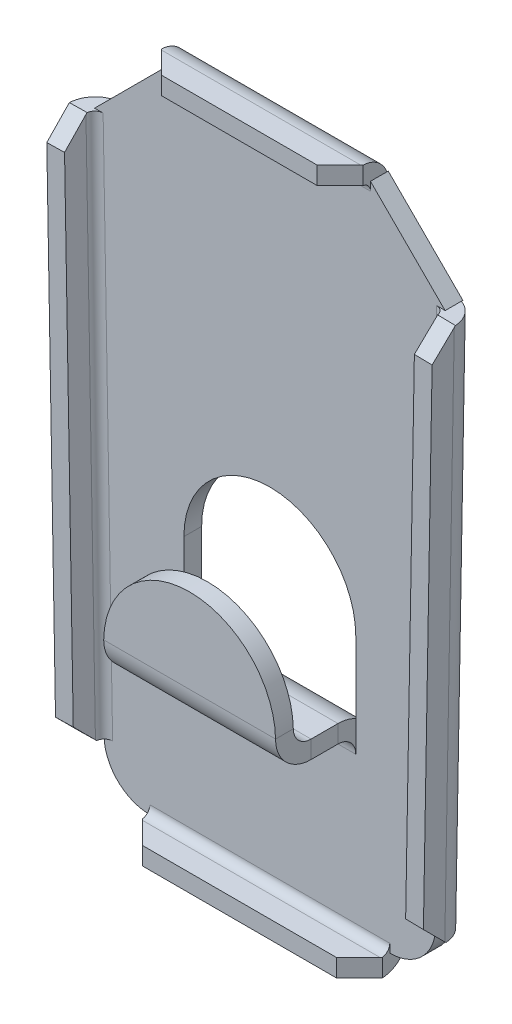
ISO-10303-21;
HEADER;
FILE_DESCRIPTION(('STEP AP214'),'2;1');
FILE_NAME('part.step','',(''),(''),'','','');
FILE_SCHEMA(('AUTOMOTIVE_DESIGN { 1 0 10303 214 1 1 1 1 }'));
ENDSEC;
DATA;
#1=APPLICATION_CONTEXT('core data for automotive mechanical design processes');
#2=APPLICATION_PROTOCOL_DEFINITION('international standard','automotive_design',2000,#1);
#3=PRODUCT_CONTEXT('',#1,'mechanical');
#4=PRODUCT('Part','Part','',(#3));
#5=PRODUCT_RELATED_PRODUCT_CATEGORY('part','',(#4));
#6=PRODUCT_DEFINITION_FORMATION('','',#4);
#7=PRODUCT_DEFINITION_CONTEXT('part definition',#1,'design');
#8=PRODUCT_DEFINITION('design','',#6,#7);
#9=PRODUCT_DEFINITION_SHAPE('','',#8);
#10=(LENGTH_UNIT() NAMED_UNIT(*) SI_UNIT(.MILLI.,.METRE.));
#11=(NAMED_UNIT(*) PLANE_ANGLE_UNIT() SI_UNIT($,.RADIAN.));
#12=(NAMED_UNIT(*) SI_UNIT($,.STERADIAN.) SOLID_ANGLE_UNIT());
#13=UNCERTAINTY_MEASURE_WITH_UNIT(LENGTH_MEASURE(1.E-05),#10,'distance_accuracy_value','');
#14=(GEOMETRIC_REPRESENTATION_CONTEXT(3) GLOBAL_UNCERTAINTY_ASSIGNED_CONTEXT((#13)) GLOBAL_UNIT_ASSIGNED_CONTEXT((#10,
#11,#12)) REPRESENTATION_CONTEXT('',''));
#15=CARTESIAN_POINT('',(0.,0.,0.));
#16=DIRECTION('',(0.,0.,1.));
#17=DIRECTION('',(1.,0.,0.));
#18=AXIS2_PLACEMENT_3D('',#15,#16,#17);
#19=CARTESIAN_POINT('',(0.,0.,4.34339999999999));
#20=DIRECTION('',(0.,0.,-1.));
#21=DIRECTION('',(-1.,0.,0.));
#22=AXIS2_PLACEMENT_3D('',#19,#20,#21);
#23=PLANE('',#22);
#24=DIRECTION('',(1.,0.,0.));
#25=VECTOR('',#24,1.);
#26=CARTESIAN_POINT('',(-3.81000000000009,9.24560000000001,4.34339999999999));
#27=LINE('',#26,#25);
#28=CARTESIAN_POINT('',(3.81000000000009,9.24560000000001,4.34339999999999));
#29=VERTEX_POINT('',#28);
#30=CARTESIAN_POINT('',(-3.81000000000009,9.24560000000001,4.34339999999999));
#31=VERTEX_POINT('',#30);
#32=EDGE_CURVE('E480',#29,#31,#27,.F.);
#33=ORIENTED_EDGE('',*,*,#32,.F.);
#34=CARTESIAN_POINT('',(0.,9.18130351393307,4.34339999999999));
#35=DIRECTION('',(0.,0.,1.));
#36=DIRECTION('',(1.,0.,0.));
#37=AXIS2_PLACEMENT_3D('',#34,#35,#36);
#38=CIRCLE('',#37,3.81054248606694);
#39=EDGE_CURVE('E449',#29,#31,#38,.T.);
#40=ORIENTED_EDGE('',*,*,#39,.T.);
#41=EDGE_LOOP('',(#33,#40));
#42=FACE_BOUND('',#41,.T.);
#43=ADVANCED_FACE('F89',(#42),#23,.F.);
#44=CARTESIAN_POINT('',(0.,0.,3.55599999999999));
#45=DIRECTION('',(0.,0.,-1.));
#46=DIRECTION('',(-1.,0.,0.));
#47=AXIS2_PLACEMENT_3D('',#44,#45,#46);
#48=PLANE('',#47);
#49=CARTESIAN_POINT('',(0.,9.18130351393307,3.55599999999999));
#50=DIRECTION('',(0.,0.,-1.));
#51=DIRECTION('',(-1.,0.,0.));
#52=AXIS2_PLACEMENT_3D('',#49,#50,#51);
#53=CIRCLE('',#52,3.81054248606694);
#54=CARTESIAN_POINT('',(3.81000000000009,9.24560000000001,3.55599999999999));
#55=VERTEX_POINT('',#54);
#56=CARTESIAN_POINT('',(-3.81000000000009,9.24560000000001,3.55599999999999));
#57=VERTEX_POINT('',#56);
#58=EDGE_CURVE('E439',#55,#57,#53,.F.);
#59=ORIENTED_EDGE('',*,*,#58,.F.);
#60=DIRECTION('',(1.,0.,0.));
#61=VECTOR('',#60,1.);
#62=CARTESIAN_POINT('',(-3.81000000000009,9.24560000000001,3.55599999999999));
#63=LINE('',#62,#61);
#64=EDGE_CURVE('E451',#57,#55,#63,.T.);
#65=ORIENTED_EDGE('',*,*,#64,.F.);
#66=EDGE_LOOP('',(#59,#65));
#67=FACE_BOUND('',#66,.T.);
#68=ADVANCED_FACE('F453',(#67),#48,.T.);
#69=CARTESIAN_POINT('',(5.3187536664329,2.032,0.7874));
#70=DIRECTION('',(0.,0.,-1.));
#71=DIRECTION('',(-1.,0.,0.));
#72=AXIS2_PLACEMENT_3D('',#69,#70,#71);
#73=PLANE('',#72);
#74=DIRECTION('',(0.,1.,0.));
#75=VECTOR('',#74,1.);
#76=CARTESIAN_POINT('',(5.3187536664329,0.,0.7874));
#77=LINE('',#76,#75);
#78=CARTESIAN_POINT('',(5.3187536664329,0.,0.7874));
#79=VERTEX_POINT('',#78);
#80=CARTESIAN_POINT('',(5.3187536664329,0.380999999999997,0.7874));
#81=VERTEX_POINT('',#80);
#82=EDGE_CURVE('E582',#79,#81,#77,.T.);
#83=ORIENTED_EDGE('',*,*,#82,.F.);
#84=CARTESIAN_POINT('',(5.3187536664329,2.032,0.7874));
#85=DIRECTION('',(0.,0.,1.));
#86=DIRECTION('',(-1.,0.,0.));
#87=AXIS2_PLACEMENT_3D('',#84,#85,#86);
#88=CIRCLE('',#87,2.032);
#89=CARTESIAN_POINT('',(7.35043713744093,1.99613534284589,0.7874));
#90=VERTEX_POINT('',#89);
#91=EDGE_CURVE('E717',#79,#90,#88,.T.);
#92=ORIENTED_EDGE('',*,*,#91,.T.);
#93=DIRECTION('',(0.99984422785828,-0.0176499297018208,0.));
#94=VECTOR('',#93,1.);
#95=CARTESIAN_POINT('',(6.96949648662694,2.00285996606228,0.787400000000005));
#96=LINE('',#95,#94);
#97=CARTESIAN_POINT('',(6.96949648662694,2.00285996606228,0.787400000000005));
#98=VERTEX_POINT('',#97);
#99=EDGE_CURVE('E654',#98,#90,#96,.T.);
#100=ORIENTED_EDGE('',*,*,#99,.F.);
#101=DIRECTION('',(0.0176499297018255,0.99984422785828,0.));
#102=VECTOR('',#101,1.);
#103=CARTESIAN_POINT('',(7.391459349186,25.9064754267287,0.787400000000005));
#104=LINE('',#103,#102);
#105=CARTESIAN_POINT('',(7.391459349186,25.9064754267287,0.787400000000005));
#106=VERTEX_POINT('',#105);
#107=EDGE_CURVE('E660',#106,#98,#104,.F.);
#108=ORIENTED_EDGE('',*,*,#107,.F.);
#109=DIRECTION('',(-0.99984422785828,0.0176499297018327,0.));
#110=VECTOR('',#109,1.);
#111=CARTESIAN_POINT('',(7.7724,25.8997508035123,0.7874));
#112=LINE('',#111,#110);
#113=CARTESIAN_POINT('',(7.7724,25.8997508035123,0.7874));
#114=VERTEX_POINT('',#113);
#115=EDGE_CURVE('E664',#114,#106,#112,.T.);
#116=ORIENTED_EDGE('',*,*,#115,.F.);
#117=DIRECTION('',(-0.707106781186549,0.707106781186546,0.));
#118=VECTOR('',#117,1.);
#119=CARTESIAN_POINT('',(7.7724,25.8997508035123,0.7874));
#120=LINE('',#119,#118);
#121=CARTESIAN_POINT('',(4.4621508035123,29.21,0.7874));
#122=VERTEX_POINT('',#121);
#123=EDGE_CURVE('E719',#114,#122,#120,.T.);
#124=ORIENTED_EDGE('',*,*,#123,.T.);
#125=DIRECTION('',(0.,1.,0.));
#126=VECTOR('',#125,1.);
#127=CARTESIAN_POINT('',(4.4621508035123,28.829,0.787400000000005));
#128=LINE('',#127,#126);
#129=CARTESIAN_POINT('',(4.4621508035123,28.829,0.787400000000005));
#130=VERTEX_POINT('',#129);
#131=EDGE_CURVE('E696',#130,#122,#128,.T.);
#132=ORIENTED_EDGE('',*,*,#131,.F.);
#133=DIRECTION('',(-1.,0.,0.));
#134=VECTOR('',#133,1.);
#135=CARTESIAN_POINT('',(-4.4621508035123,28.829,0.787400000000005));
#136=LINE('',#135,#134);
#137=CARTESIAN_POINT('',(-4.4621508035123,28.829,0.787400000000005));
#138=VERTEX_POINT('',#137);
#139=EDGE_CURVE('E702',#138,#130,#136,.F.);
#140=ORIENTED_EDGE('',*,*,#139,.F.);
#141=DIRECTION('',(0.,-1.,0.));
#142=VECTOR('',#141,1.);
#143=CARTESIAN_POINT('',(-4.4621508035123,29.21,0.7874));
#144=LINE('',#143,#142);
#145=CARTESIAN_POINT('',(-4.4621508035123,29.21,0.7874));
#146=VERTEX_POINT('',#145);
#147=EDGE_CURVE('E706',#146,#138,#144,.T.);
#148=ORIENTED_EDGE('',*,*,#147,.F.);
#149=DIRECTION('',(-0.707106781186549,-0.707106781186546,0.));
#150=VECTOR('',#149,1.);
#151=CARTESIAN_POINT('',(-7.7724,25.8997508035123,0.7874));
#152=LINE('',#151,#150);
#153=CARTESIAN_POINT('',(-7.7724,25.8997508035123,0.7874));
#154=VERTEX_POINT('',#153);
#155=EDGE_CURVE('E712',#146,#154,#152,.T.);
#156=ORIENTED_EDGE('',*,*,#155,.T.);
#157=DIRECTION('',(-0.99984422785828,-0.017649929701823,0.));
#158=VECTOR('',#157,1.);
#159=CARTESIAN_POINT('',(-7.39145934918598,25.9064754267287,0.78739999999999));
#160=LINE('',#159,#158);
#161=CARTESIAN_POINT('',(-7.39145934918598,25.9064754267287,0.78739999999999));
#162=VERTEX_POINT('',#161);
#163=EDGE_CURVE('E614',#162,#154,#160,.T.);
#164=ORIENTED_EDGE('',*,*,#163,.F.);
#165=DIRECTION('',(0.0176499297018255,-0.99984422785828,0.));
#166=VECTOR('',#165,1.);
#167=CARTESIAN_POINT('',(-6.96949648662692,2.00285996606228,0.787399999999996));
#168=LINE('',#167,#166);
#169=CARTESIAN_POINT('',(-6.96949648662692,2.00285996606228,0.787399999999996));
#170=VERTEX_POINT('',#169);
#171=EDGE_CURVE('E620',#170,#162,#168,.F.);
#172=ORIENTED_EDGE('',*,*,#171,.F.);
#173=DIRECTION('',(0.99984422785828,0.0176499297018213,0.));
#174=VECTOR('',#173,1.);
#175=CARTESIAN_POINT('',(-7.35043713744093,1.99613534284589,0.7874));
#176=LINE('',#175,#174);
#177=CARTESIAN_POINT('',(-7.35043713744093,1.99613534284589,0.7874));
#178=VERTEX_POINT('',#177);
#179=EDGE_CURVE('E624',#178,#170,#176,.T.);
#180=ORIENTED_EDGE('',*,*,#179,.F.);
#181=CARTESIAN_POINT('',(-5.3187536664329,2.032,0.7874));
#182=DIRECTION('',(0.,0.,1.));
#183=DIRECTION('',(-1.,0.,0.));
#184=AXIS2_PLACEMENT_3D('',#181,#182,#183);
#185=CIRCLE('',#184,2.032);
#186=CARTESIAN_POINT('',(-5.3187536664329,0.,0.7874));
#187=VERTEX_POINT('',#186);
#188=EDGE_CURVE('E714',#178,#187,#185,.T.);
#189=ORIENTED_EDGE('',*,*,#188,.T.);
#190=DIRECTION('',(0.,-1.,0.));
#191=VECTOR('',#190,1.);
#192=CARTESIAN_POINT('',(-5.3187536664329,0.380999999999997,0.7874));
#193=LINE('',#192,#191);
#194=CARTESIAN_POINT('',(-5.3187536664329,0.380999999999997,0.7874));
#195=VERTEX_POINT('',#194);
#196=EDGE_CURVE('E572',#195,#187,#193,.T.);
#197=ORIENTED_EDGE('',*,*,#196,.F.);
#198=DIRECTION('',(1.,0.,0.));
#199=VECTOR('',#198,1.);
#200=CARTESIAN_POINT('',(5.3187536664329,0.380999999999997,0.7874));
#201=LINE('',#200,#199);
#202=EDGE_CURVE('E578',#81,#195,#201,.F.);
#203=ORIENTED_EDGE('',*,*,#202,.F.);
#204=EDGE_LOOP('',(#83,#92,#100,#108,#116,#124,#132,#140,#148,#156,#164,#172,#180,#189,#197,#203));
#205=FACE_BOUND('',#204,.T.);
#206=DIRECTION('',(-1.,0.,0.));
#207=VECTOR('',#206,1.);
#208=CARTESIAN_POINT('',(-3.81000000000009,6.8834,0.787400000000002));
#209=LINE('',#208,#207);
#210=CARTESIAN_POINT('',(-3.81000000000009,6.8834,0.787400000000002));
#211=VERTEX_POINT('',#210);
#212=CARTESIAN_POINT('',(3.81000000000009,6.8834,0.787400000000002));
#213=VERTEX_POINT('',#212);
#214=EDGE_CURVE('E525',#211,#213,#209,.F.);
#215=ORIENTED_EDGE('',*,*,#214,.F.);
#216=DIRECTION('',(0.,-1.,0.));
#217=VECTOR('',#216,1.);
#218=CARTESIAN_POINT('',(-3.81000000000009,8.4582,0.7874));
#219=LINE('',#218,#217);
#220=CARTESIAN_POINT('',(-3.81000000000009,8.24721680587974,0.7874));
#221=VERTEX_POINT('',#220);
#222=EDGE_CURVE('E518',#221,#211,#219,.T.);
#223=ORIENTED_EDGE('',*,*,#222,.F.);
#224=CARTESIAN_POINT('',(-3.81000000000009,11.4311384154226,0.7874));
#225=VERTEX_POINT('',#224);
#226=EDGE_CURVE('E539',#225,#221,#219,.T.);
#227=ORIENTED_EDGE('',*,*,#226,.F.);
#228=CARTESIAN_POINT('',(0.,11.4311384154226,0.7874));
#229=DIRECTION('',(0.,0.,1.));
#230=DIRECTION('',(1.,0.,0.));
#231=AXIS2_PLACEMENT_3D('',#228,#229,#230);
#232=CIRCLE('',#231,3.81000000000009);
#233=CARTESIAN_POINT('',(3.81000000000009,11.4311384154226,0.7874));
#234=VERTEX_POINT('',#233);
#235=EDGE_CURVE('E533',#234,#225,#232,.T.);
#236=ORIENTED_EDGE('',*,*,#235,.F.);
#237=DIRECTION('',(0.,1.,0.));
#238=VECTOR('',#237,1.);
#239=CARTESIAN_POINT('',(3.81000000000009,8.4582,0.7874));
#240=LINE('',#239,#238);
#241=CARTESIAN_POINT('',(3.81000000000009,8.24721680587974,0.7874));
#242=VERTEX_POINT('',#241);
#243=EDGE_CURVE('E541',#242,#234,#240,.T.);
#244=ORIENTED_EDGE('',*,*,#243,.F.);
#245=EDGE_CURVE('E542',#213,#242,#240,.T.);
#246=ORIENTED_EDGE('',*,*,#245,.F.);
#247=EDGE_LOOP('',(#215,#223,#227,#236,#244,#246));
#248=FACE_BOUND('',#247,.T.);
#249=ADVANCED_FACE('F878',(#205,#248),#73,.F.);
#250=CARTESIAN_POINT('',(5.3187536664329,2.032,0.));
#251=DIRECTION('',(0.,0.,-1.));
#252=DIRECTION('',(-1.,0.,0.));
#253=AXIS2_PLACEMENT_3D('',#250,#251,#252);
#254=PLANE('',#253);
#255=CARTESIAN_POINT('',(0.,20.066,0.));
#256=DIRECTION('',(0.,0.,-1.));
#257=DIRECTION('',(-1.,0.,0.));
#258=AXIS2_PLACEMENT_3D('',#255,#256,#257);
#259=CIRCLE('',#258,1.9812);
#260=CARTESIAN_POINT('',(-1.9812,20.066,0.));
#261=VERTEX_POINT('',#260);
#262=EDGE_CURVE('E1296',#261,#261,#259,.T.);
#263=ORIENTED_EDGE('',*,*,#262,.F.);
#264=EDGE_LOOP('',(#263));
#265=FACE_BOUND('',#264,.T.);
#266=CARTESIAN_POINT('',(5.3187536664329,2.032,0.));
#267=DIRECTION('',(0.,0.,1.));
#268=DIRECTION('',(-1.,0.,0.));
#269=AXIS2_PLACEMENT_3D('',#266,#267,#268);
#270=CIRCLE('',#269,2.032);
#271=CARTESIAN_POINT('',(5.3187536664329,0.,0.));
#272=VERTEX_POINT('',#271);
#273=CARTESIAN_POINT('',(7.35043713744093,1.99613534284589,0.));
#274=VERTEX_POINT('',#273);
#275=EDGE_CURVE('E727',#272,#274,#270,.T.);
#276=ORIENTED_EDGE('',*,*,#275,.F.);
#277=DIRECTION('',(0.,1.,0.));
#278=VECTOR('',#277,1.);
#279=CARTESIAN_POINT('',(5.3187536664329,2.032,0.));
#280=LINE('',#279,#278);
#281=CARTESIAN_POINT('',(5.3187536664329,0.381000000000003,0.));
#282=VERTEX_POINT('',#281);
#283=EDGE_CURVE('E585',#272,#282,#280,.T.);
#284=ORIENTED_EDGE('',*,*,#283,.T.);
#285=DIRECTION('',(1.,0.,0.));
#286=VECTOR('',#285,1.);
#287=CARTESIAN_POINT('',(5.3187536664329,0.380999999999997,0.));
#288=LINE('',#287,#286);
#289=CARTESIAN_POINT('',(-5.3187536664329,0.381000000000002,0.));
#290=VERTEX_POINT('',#289);
#291=EDGE_CURVE('E564',#282,#290,#288,.F.);
#292=ORIENTED_EDGE('',*,*,#291,.T.);
#293=DIRECTION('',(0.,-1.,0.));
#294=VECTOR('',#293,1.);
#295=CARTESIAN_POINT('',(-5.3187536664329,2.032,0.));
#296=LINE('',#295,#294);
#297=CARTESIAN_POINT('',(-5.3187536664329,0.,0.));
#298=VERTEX_POINT('',#297);
#299=EDGE_CURVE('E590',#290,#298,#296,.T.);
#300=ORIENTED_EDGE('',*,*,#299,.T.);
#301=CARTESIAN_POINT('',(-5.3187536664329,2.032,0.));
#302=DIRECTION('',(0.,0.,1.));
#303=DIRECTION('',(-1.,0.,0.));
#304=AXIS2_PLACEMENT_3D('',#301,#302,#303);
#305=CIRCLE('',#304,2.032);
#306=CARTESIAN_POINT('',(-7.35043713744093,1.99613534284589,0.));
#307=VERTEX_POINT('',#306);
#308=EDGE_CURVE('E724',#307,#298,#305,.T.);
#309=ORIENTED_EDGE('',*,*,#308,.F.);
#310=DIRECTION('',(0.99984422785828,0.0176499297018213,0.));
#311=VECTOR('',#310,1.);
#312=CARTESIAN_POINT('',(5.315439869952,2.21972201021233,0.));
#313=LINE('',#312,#311);
#314=CARTESIAN_POINT('',(-6.96949648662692,2.00285996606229,0.));
#315=VERTEX_POINT('',#314);
#316=EDGE_CURVE('E627',#307,#315,#313,.T.);
#317=ORIENTED_EDGE('',*,*,#316,.T.);
#318=DIRECTION('',(0.0176499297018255,-0.99984422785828,0.));
#319=VECTOR('',#318,1.);
#320=CARTESIAN_POINT('',(-6.96949648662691,2.00285996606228,0.));
#321=LINE('',#320,#319);
#322=CARTESIAN_POINT('',(-7.39145934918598,25.9064754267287,0.));
#323=VERTEX_POINT('',#322);
#324=EDGE_CURVE('E606',#315,#323,#321,.F.);
#325=ORIENTED_EDGE('',*,*,#324,.T.);
#326=DIRECTION('',(-0.99984422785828,-0.017649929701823,0.));
#327=VECTOR('',#326,1.);
#328=CARTESIAN_POINT('',(4.893477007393,26.1233374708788,0.));
#329=LINE('',#328,#327);
#330=CARTESIAN_POINT('',(-7.7724,25.8997508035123,0.));
#331=VERTEX_POINT('',#330);
#332=EDGE_CURVE('E632',#323,#331,#329,.T.);
#333=ORIENTED_EDGE('',*,*,#332,.T.);
#334=DIRECTION('',(-0.707106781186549,-0.707106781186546,0.));
#335=VECTOR('',#334,1.);
#336=CARTESIAN_POINT('',(-7.7724,25.8997508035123,0.));
#337=LINE('',#336,#335);
#338=CARTESIAN_POINT('',(-4.4621508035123,29.21,0.));
#339=VERTEX_POINT('',#338);
#340=EDGE_CURVE('E709',#339,#331,#337,.T.);
#341=ORIENTED_EDGE('',*,*,#340,.F.);
#342=DIRECTION('',(0.,-1.,0.));
#343=VECTOR('',#342,1.);
#344=CARTESIAN_POINT('',(-4.46215080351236,2.03200000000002,0.));
#345=LINE('',#344,#343);
#346=CARTESIAN_POINT('',(-4.4621508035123,28.829,0.));
#347=VERTEX_POINT('',#346);
#348=EDGE_CURVE('E766',#339,#347,#345,.T.);
#349=ORIENTED_EDGE('',*,*,#348,.T.);
#350=DIRECTION('',(-1.,0.,0.));
#351=VECTOR('',#350,1.);
#352=CARTESIAN_POINT('',(-4.4621508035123,28.829,0.));
#353=LINE('',#352,#351);
#354=CARTESIAN_POINT('',(4.4621508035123,28.829,0.));
#355=VERTEX_POINT('',#354);
#356=EDGE_CURVE('E688',#347,#355,#353,.F.);
#357=ORIENTED_EDGE('',*,*,#356,.T.);
#358=DIRECTION('',(0.,1.,0.));
#359=VECTOR('',#358,1.);
#360=CARTESIAN_POINT('',(4.46215080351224,2.032,0.));
#361=LINE('',#360,#359);
#362=CARTESIAN_POINT('',(4.4621508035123,29.21,0.));
#363=VERTEX_POINT('',#362);
#364=EDGE_CURVE('E763',#355,#363,#361,.T.);
#365=ORIENTED_EDGE('',*,*,#364,.T.);
#366=DIRECTION('',(-0.707106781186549,0.707106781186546,0.));
#367=VECTOR('',#366,1.);
#368=CARTESIAN_POINT('',(7.7724,25.8997508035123,0.));
#369=LINE('',#368,#367);
#370=CARTESIAN_POINT('',(7.7724,25.8997508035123,0.));
#371=VERTEX_POINT('',#370);
#372=EDGE_CURVE('E715',#371,#363,#369,.T.);
#373=ORIENTED_EDGE('',*,*,#372,.F.);
#374=DIRECTION('',(-0.99984422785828,0.0176499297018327,0.));
#375=VECTOR('',#374,1.);
#376=CARTESIAN_POINT('',(5.74071652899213,25.9356154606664,0.));
#377=LINE('',#376,#375);
#378=CARTESIAN_POINT('',(7.391459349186,25.9064754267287,0.));
#379=VERTEX_POINT('',#378);
#380=EDGE_CURVE('E667',#371,#379,#377,.T.);
#381=ORIENTED_EDGE('',*,*,#380,.T.);
#382=DIRECTION('',(0.0176499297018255,0.99984422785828,0.));
#383=VECTOR('',#382,1.);
#384=CARTESIAN_POINT('',(7.39145934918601,25.9064754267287,0.));
#385=LINE('',#384,#383);
#386=CARTESIAN_POINT('',(6.96949648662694,2.00285996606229,0.));
#387=VERTEX_POINT('',#386);
#388=EDGE_CURVE('E646',#379,#387,#385,.F.);
#389=ORIENTED_EDGE('',*,*,#388,.T.);
#390=DIRECTION('',(0.99984422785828,-0.0176499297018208,0.));
#391=VECTOR('',#390,1.);
#392=CARTESIAN_POINT('',(5.3187536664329,2.03199999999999,0.));
#393=LINE('',#392,#391);
#394=EDGE_CURVE('E672',#387,#274,#393,.T.);
#395=ORIENTED_EDGE('',*,*,#394,.T.);
#396=EDGE_LOOP('',(#276,#284,#292,#300,#309,#317,#325,#333,#341,#349,#357,#365,#373,#381,#389,#395));
#397=FACE_BOUND('',#396,.T.);
#398=DIRECTION('',(0.,-1.,0.));
#399=VECTOR('',#398,1.);
#400=CARTESIAN_POINT('',(-3.81000000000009,8.4582,0.));
#401=LINE('',#400,#399);
#402=CARTESIAN_POINT('',(-3.81000000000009,11.4311384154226,0.));
#403=VERTEX_POINT('',#402);
#404=CARTESIAN_POINT('',(-3.81000000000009,6.88340000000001,0.));
#405=VERTEX_POINT('',#404);
#406=EDGE_CURVE('E530',#403,#405,#401,.T.);
#407=ORIENTED_EDGE('',*,*,#406,.T.);
#408=DIRECTION('',(-1.,0.,0.));
#409=VECTOR('',#408,1.);
#410=CARTESIAN_POINT('',(-3.81000000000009,6.8834,0.));
#411=LINE('',#410,#409);
#412=CARTESIAN_POINT('',(3.81000000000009,6.88340000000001,0.));
#413=VERTEX_POINT('',#412);
#414=EDGE_CURVE('E511',#405,#413,#411,.F.);
#415=ORIENTED_EDGE('',*,*,#414,.T.);
#416=DIRECTION('',(0.,1.,0.));
#417=VECTOR('',#416,1.);
#418=CARTESIAN_POINT('',(3.81000000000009,8.4582,0.));
#419=LINE('',#418,#417);
#420=CARTESIAN_POINT('',(3.81000000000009,11.4311384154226,0.));
#421=VERTEX_POINT('',#420);
#422=EDGE_CURVE('E532',#413,#421,#419,.T.);
#423=ORIENTED_EDGE('',*,*,#422,.T.);
#424=CARTESIAN_POINT('',(0.,11.4311384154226,0.));
#425=DIRECTION('',(0.,0.,1.));
#426=DIRECTION('',(1.,0.,0.));
#427=AXIS2_PLACEMENT_3D('',#424,#425,#426);
#428=CIRCLE('',#427,3.81000000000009);
#429=EDGE_CURVE('E535',#421,#403,#428,.T.);
#430=ORIENTED_EDGE('',*,*,#429,.T.);
#431=EDGE_LOOP('',(#407,#415,#423,#430));
#432=FACE_BOUND('',#431,.T.);
#433=ADVANCED_FACE('F908',(#265,#397,#432),#254,.T.);
#434=CARTESIAN_POINT('',(5.3187536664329,0.,0.7874));
#435=DIRECTION('',(-1.,0.,0.));
#436=DIRECTION('',(0.,-1.,0.));
#437=AXIS2_PLACEMENT_3D('',#434,#435,#436);
#438=PLANE('',#437);
#439=DIRECTION('',(0.,0.,-1.));
#440=VECTOR('',#439,1.);
#441=CARTESIAN_POINT('',(5.3187536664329,0.,0.7874));
#442=LINE('',#441,#440);
#443=CARTESIAN_POINT('',(5.3187536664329,0.,0.0638650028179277));
#444=VERTEX_POINT('',#443);
#445=EDGE_CURVE('E747',#444,#272,#442,.T.);
#446=ORIENTED_EDGE('',*,*,#445,.F.);
#447=CARTESIAN_POINT('',(5.3187536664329,0.380999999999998,1.1684));
#448=DIRECTION('',(1.,0.,0.));
#449=DIRECTION('',(0.,1.,0.));
#450=AXIS2_PLACEMENT_3D('',#447,#448,#449);
#451=CIRCLE('',#450,1.1684);
#452=EDGE_CURVE('E575',#444,#282,#451,.T.);
#453=ORIENTED_EDGE('',*,*,#452,.T.);
#454=ORIENTED_EDGE('',*,*,#283,.F.);
#455=EDGE_LOOP('',(#446,#453,#454));
#456=FACE_BOUND('',#455,.T.);
#457=ADVANCED_FACE('F1036',(#456),#438,.T.);
#458=CARTESIAN_POINT('',(-5.3187536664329,0.380999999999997,0.7874));
#459=DIRECTION('',(1.,0.,0.));
#460=DIRECTION('',(0.,0.,-1.));
#461=AXIS2_PLACEMENT_3D('',#458,#459,#460);
#462=PLANE('',#461);
#463=ORIENTED_EDGE('',*,*,#299,.F.);
#464=CARTESIAN_POINT('',(-5.3187536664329,0.380999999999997,1.1684));
#465=DIRECTION('',(1.,0.,0.));
#466=DIRECTION('',(0.,1.,0.));
#467=AXIS2_PLACEMENT_3D('',#464,#465,#466);
#468=CIRCLE('',#467,1.1684);
#469=CARTESIAN_POINT('',(-5.3187536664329,0.,0.0638650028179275));
#470=VERTEX_POINT('',#469);
#471=EDGE_CURVE('E569',#290,#470,#468,.F.);
#472=ORIENTED_EDGE('',*,*,#471,.T.);
#473=DIRECTION('',(0.,0.,-1.));
#474=VECTOR('',#473,1.);
#475=CARTESIAN_POINT('',(-5.3187536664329,0.,0.7874));
#476=LINE('',#475,#474);
#477=EDGE_CURVE('E751',#470,#298,#476,.T.);
#478=ORIENTED_EDGE('',*,*,#477,.T.);
#479=EDGE_LOOP('',(#463,#472,#478));
#480=FACE_BOUND('',#479,.T.);
#481=ADVANCED_FACE('F1033',(#480),#462,.T.);
#482=CARTESIAN_POINT('',(-7.35043713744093,1.99613534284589,0.7874));
#483=DIRECTION('',(-0.0176499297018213,0.99984422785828,0.));
#484=DIRECTION('',(-0.99984422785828,-0.0176499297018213,0.));
#485=AXIS2_PLACEMENT_3D('',#482,#483,#484);
#486=PLANE('',#485);
#487=DIRECTION('',(0.,0.,-1.));
#488=VECTOR('',#487,1.);
#489=CARTESIAN_POINT('',(-7.35043713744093,1.99613534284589,0.7874));
#490=LINE('',#489,#488);
#491=CARTESIAN_POINT('',(-7.35043713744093,1.99613534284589,0.0638650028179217));
#492=VERTEX_POINT('',#491);
#493=EDGE_CURVE('E755',#492,#307,#490,.T.);
#494=ORIENTED_EDGE('',*,*,#493,.F.);
#495=CARTESIAN_POINT('',(-6.96949648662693,2.00285996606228,1.1684));
#496=DIRECTION('',(0.0176499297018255,-0.99984422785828,0.));
#497=DIRECTION('',(0.99984422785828,0.0176499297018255,0.));
#498=AXIS2_PLACEMENT_3D('',#495,#496,#497);
#499=CIRCLE('',#498,1.16840000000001);
#500=EDGE_CURVE('E617',#492,#315,#499,.T.);
#501=ORIENTED_EDGE('',*,*,#500,.T.);
#502=ORIENTED_EDGE('',*,*,#316,.F.);
#503=EDGE_LOOP('',(#494,#501,#502));
#504=FACE_BOUND('',#503,.T.);
#505=ADVANCED_FACE('F933',(#504),#486,.T.);
#506=CARTESIAN_POINT('',(-7.39145934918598,25.9064754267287,0.78739999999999));
#507=DIRECTION('',(0.017649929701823,-0.99984422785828,0.));
#508=DIRECTION('',(0.99984422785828,0.017649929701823,0.));
#509=AXIS2_PLACEMENT_3D('',#506,#507,#508);
#510=PLANE('',#509);
#511=ORIENTED_EDGE('',*,*,#332,.F.);
#512=CARTESIAN_POINT('',(-7.39145934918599,25.9064754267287,1.1684));
#513=DIRECTION('',(0.0176499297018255,-0.99984422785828,0.));
#514=DIRECTION('',(0.99984422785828,0.0176499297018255,0.));
#515=AXIS2_PLACEMENT_3D('',#512,#513,#514);
#516=CIRCLE('',#515,1.16840000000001);
#517=CARTESIAN_POINT('',(-7.7724,25.8997508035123,0.0638650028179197));
#518=VERTEX_POINT('',#517);
#519=EDGE_CURVE('E611',#323,#518,#516,.F.);
#520=ORIENTED_EDGE('',*,*,#519,.T.);
#521=DIRECTION('',(0.,0.,-1.));
#522=VECTOR('',#521,1.);
#523=CARTESIAN_POINT('',(-7.7724,25.8997508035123,0.7874));
#524=LINE('',#523,#522);
#525=EDGE_CURVE('E759',#518,#331,#524,.T.);
#526=ORIENTED_EDGE('',*,*,#525,.T.);
#527=EDGE_LOOP('',(#511,#520,#526));
#528=FACE_BOUND('',#527,.T.);
#529=ADVANCED_FACE('F924',(#528),#510,.T.);
#530=CARTESIAN_POINT('',(7.7724,25.8997508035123,0.7874));
#531=DIRECTION('',(-0.0176499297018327,-0.99984422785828,0.));
#532=DIRECTION('',(0.99984422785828,-0.0176499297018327,0.));
#533=AXIS2_PLACEMENT_3D('',#530,#531,#532);
#534=PLANE('',#533);
#535=DIRECTION('',(0.,0.,-1.));
#536=VECTOR('',#535,1.);
#537=CARTESIAN_POINT('',(7.7724,25.8997508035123,0.7874));
#538=LINE('',#537,#536);
#539=CARTESIAN_POINT('',(7.7724,25.8997508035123,0.0638650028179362));
#540=VERTEX_POINT('',#539);
#541=EDGE_CURVE('E739',#540,#371,#538,.T.);
#542=ORIENTED_EDGE('',*,*,#541,.F.);
#543=CARTESIAN_POINT('',(7.39145934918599,25.9064754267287,1.1684));
#544=DIRECTION('',(0.0176499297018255,0.99984422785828,0.));
#545=DIRECTION('',(-0.99984422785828,0.0176499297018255,0.));
#546=AXIS2_PLACEMENT_3D('',#543,#544,#545);
#547=CIRCLE('',#546,1.16839999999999);
#548=EDGE_CURVE('E657',#540,#379,#547,.T.);
#549=ORIENTED_EDGE('',*,*,#548,.T.);
#550=ORIENTED_EDGE('',*,*,#380,.F.);
#551=EDGE_LOOP('',(#542,#549,#550));
#552=FACE_BOUND('',#551,.T.);
#553=ADVANCED_FACE('F921',(#552),#534,.T.);
#554=CARTESIAN_POINT('',(6.96949648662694,2.00285996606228,0.787400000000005));
#555=DIRECTION('',(0.0176499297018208,0.99984422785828,0.));
#556=DIRECTION('',(-0.99984422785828,0.0176499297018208,0.));
#557=AXIS2_PLACEMENT_3D('',#554,#555,#556);
#558=PLANE('',#557);
#559=ORIENTED_EDGE('',*,*,#394,.F.);
#560=CARTESIAN_POINT('',(6.96949648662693,2.00285996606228,1.1684));
#561=DIRECTION('',(0.0176499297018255,0.99984422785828,0.));
#562=DIRECTION('',(-0.99984422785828,0.0176499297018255,0.));
#563=AXIS2_PLACEMENT_3D('',#560,#561,#562);
#564=CIRCLE('',#563,1.16839999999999);
#565=CARTESIAN_POINT('',(7.35043713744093,1.99613534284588,0.0638650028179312));
#566=VERTEX_POINT('',#565);
#567=EDGE_CURVE('E651',#387,#566,#564,.F.);
#568=ORIENTED_EDGE('',*,*,#567,.T.);
#569=DIRECTION('',(0.,0.,-1.));
#570=VECTOR('',#569,1.);
#571=CARTESIAN_POINT('',(7.35043713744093,1.99613534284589,0.7874));
#572=LINE('',#571,#570);
#573=EDGE_CURVE('E743',#566,#274,#572,.T.);
#574=ORIENTED_EDGE('',*,*,#573,.T.);
#575=EDGE_LOOP('',(#559,#568,#574));
#576=FACE_BOUND('',#575,.T.);
#577=ADVANCED_FACE('F923',(#576),#558,.T.);
#578=CARTESIAN_POINT('',(-4.4621508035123,29.21,0.7874));
#579=DIRECTION('',(1.,0.,0.));
#580=DIRECTION('',(0.,1.,0.));
#581=AXIS2_PLACEMENT_3D('',#578,#579,#580);
#582=PLANE('',#581);
#583=DIRECTION('',(0.,0.,-1.));
#584=VECTOR('',#583,1.);
#585=CARTESIAN_POINT('',(-4.4621508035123,29.21,0.7874));
#586=LINE('',#585,#584);
#587=CARTESIAN_POINT('',(-4.4621508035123,29.21,0.0638650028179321));
#588=VERTEX_POINT('',#587);
#589=EDGE_CURVE('E721',#588,#339,#586,.T.);
#590=ORIENTED_EDGE('',*,*,#589,.F.);
#591=CARTESIAN_POINT('',(-4.4621508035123,28.829,1.1684));
#592=DIRECTION('',(-1.,0.,0.));
#593=DIRECTION('',(0.,0.,1.));
#594=AXIS2_PLACEMENT_3D('',#591,#592,#593);
#595=CIRCLE('',#594,1.1684);
#596=EDGE_CURVE('E699',#588,#347,#595,.T.);
#597=ORIENTED_EDGE('',*,*,#596,.T.);
#598=ORIENTED_EDGE('',*,*,#348,.F.);
#599=EDGE_LOOP('',(#590,#597,#598));
#600=FACE_BOUND('',#599,.T.);
#601=ADVANCED_FACE('F901',(#600),#582,.T.);
#602=CARTESIAN_POINT('',(4.4621508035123,28.829,0.787400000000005));
#603=DIRECTION('',(-1.,0.,0.));
#604=DIRECTION('',(0.,-1.,0.));
#605=AXIS2_PLACEMENT_3D('',#602,#603,#604);
#606=PLANE('',#605);
#607=ORIENTED_EDGE('',*,*,#364,.F.);
#608=CARTESIAN_POINT('',(4.4621508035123,28.829,1.1684));
#609=DIRECTION('',(-1.,0.,0.));
#610=DIRECTION('',(0.,0.,1.));
#611=AXIS2_PLACEMENT_3D('',#608,#609,#610);
#612=CIRCLE('',#611,1.1684);
#613=CARTESIAN_POINT('',(4.4621508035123,29.21,0.0638650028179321));
#614=VERTEX_POINT('',#613);
#615=EDGE_CURVE('E693',#355,#614,#612,.F.);
#616=ORIENTED_EDGE('',*,*,#615,.T.);
#617=DIRECTION('',(0.,0.,-1.));
#618=VECTOR('',#617,1.);
#619=CARTESIAN_POINT('',(4.4621508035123,29.21,0.7874));
#620=LINE('',#619,#618);
#621=EDGE_CURVE('E735',#614,#363,#620,.T.);
#622=ORIENTED_EDGE('',*,*,#621,.T.);
#623=EDGE_LOOP('',(#607,#616,#622));
#624=FACE_BOUND('',#623,.T.);
#625=ADVANCED_FACE('F915',(#624),#606,.T.);
#626=CARTESIAN_POINT('',(-7.7724,25.8997508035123,0.7874));
#627=DIRECTION('',(0.707106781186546,-0.707106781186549,0.));
#628=DIRECTION('',(0.707106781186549,0.707106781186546,0.));
#629=AXIS2_PLACEMENT_3D('',#626,#627,#628);
#630=PLANE('',#629);
#631=ORIENTED_EDGE('',*,*,#340,.T.);
#632=ORIENTED_EDGE('',*,*,#525,.F.);
#633=EDGE_CURVE('E760',#154,#518,#524,.T.);
#634=ORIENTED_EDGE('',*,*,#633,.F.);
#635=ORIENTED_EDGE('',*,*,#155,.F.);
#636=EDGE_CURVE('E732',#146,#588,#586,.T.);
#637=ORIENTED_EDGE('',*,*,#636,.T.);
#638=ORIENTED_EDGE('',*,*,#589,.T.);
#639=EDGE_LOOP('',(#631,#632,#634,#635,#637,#638));
#640=FACE_BOUND('',#639,.T.);
#641=ADVANCED_FACE('F1117',(#640),#630,.F.);
#642=CARTESIAN_POINT('',(-5.3187536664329,2.032,0.7874));
#643=DIRECTION('',(0.,0.,-1.));
#644=DIRECTION('',(-1.,0.,0.));
#645=AXIS2_PLACEMENT_3D('',#642,#643,#644);
#646=CYLINDRICAL_SURFACE('',#645,2.032);
#647=ORIENTED_EDGE('',*,*,#308,.T.);
#648=ORIENTED_EDGE('',*,*,#477,.F.);
#649=EDGE_CURVE('E752',#187,#470,#476,.T.);
#650=ORIENTED_EDGE('',*,*,#649,.F.);
#651=ORIENTED_EDGE('',*,*,#188,.F.);
#652=EDGE_CURVE('E756',#178,#492,#490,.T.);
#653=ORIENTED_EDGE('',*,*,#652,.T.);
#654=ORIENTED_EDGE('',*,*,#493,.T.);
#655=EDGE_LOOP('',(#647,#648,#650,#651,#653,#654));
#656=FACE_BOUND('',#655,.T.);
#657=ADVANCED_FACE('F1130',(#656),#646,.T.);
#658=CARTESIAN_POINT('',(5.3187536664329,2.032,0.7874));
#659=DIRECTION('',(0.,0.,-1.));
#660=DIRECTION('',(-1.,0.,0.));
#661=AXIS2_PLACEMENT_3D('',#658,#659,#660);
#662=CYLINDRICAL_SURFACE('',#661,2.032);
#663=ORIENTED_EDGE('',*,*,#275,.T.);
#664=ORIENTED_EDGE('',*,*,#573,.F.);
#665=EDGE_CURVE('E744',#90,#566,#572,.T.);
#666=ORIENTED_EDGE('',*,*,#665,.F.);
#667=ORIENTED_EDGE('',*,*,#91,.F.);
#668=EDGE_CURVE('E748',#79,#444,#442,.T.);
#669=ORIENTED_EDGE('',*,*,#668,.T.);
#670=ORIENTED_EDGE('',*,*,#445,.T.);
#671=EDGE_LOOP('',(#663,#664,#666,#667,#669,#670));
#672=FACE_BOUND('',#671,.T.);
#673=ADVANCED_FACE('F1127',(#672),#662,.T.);
#674=CARTESIAN_POINT('',(7.7724,25.8997508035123,0.7874));
#675=DIRECTION('',(-0.707106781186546,-0.707106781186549,0.));
#676=DIRECTION('',(0.707106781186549,-0.707106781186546,0.));
#677=AXIS2_PLACEMENT_3D('',#674,#675,#676);
#678=PLANE('',#677);
#679=ORIENTED_EDGE('',*,*,#372,.T.);
#680=ORIENTED_EDGE('',*,*,#621,.F.);
#681=EDGE_CURVE('E736',#122,#614,#620,.T.);
#682=ORIENTED_EDGE('',*,*,#681,.F.);
#683=ORIENTED_EDGE('',*,*,#123,.F.);
#684=EDGE_CURVE('E740',#114,#540,#538,.T.);
#685=ORIENTED_EDGE('',*,*,#684,.T.);
#686=ORIENTED_EDGE('',*,*,#541,.T.);
#687=EDGE_LOOP('',(#679,#680,#682,#683,#685,#686));
#688=FACE_BOUND('',#687,.T.);
#689=ADVANCED_FACE('F889',(#688),#678,.F.);
#690=CARTESIAN_POINT('',(-4.4621508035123,28.829,1.1684));
#691=DIRECTION('',(1.,0.,0.));
#692=DIRECTION('',(0.,0.,-1.));
#693=AXIS2_PLACEMENT_3D('',#690,#691,#692);
#694=PLANE('',#693);
#695=CARTESIAN_POINT('',(-4.4621508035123,28.829,1.1684));
#696=DIRECTION('',(-1.,0.,0.));
#697=DIRECTION('',(0.,0.,1.));
#698=AXIS2_PLACEMENT_3D('',#695,#696,#697);
#699=CIRCLE('',#698,0.380999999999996);
#700=CARTESIAN_POINT('',(-4.4621508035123,29.2065981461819,1.1176));
#701=VERTEX_POINT('',#700);
#702=EDGE_CURVE('E685',#701,#138,#699,.T.);
#703=ORIENTED_EDGE('',*,*,#702,.F.);
#704=DIRECTION('',(0.,-1.,0.));
#705=VECTOR('',#704,1.);
#706=CARTESIAN_POINT('',(-4.4621508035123,28.829,1.1176));
#707=LINE('',#706,#705);
#708=CARTESIAN_POINT('',(-4.4621508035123,29.9962951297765,1.11759999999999));
#709=VERTEX_POINT('',#708);
#710=EDGE_CURVE('E13',#701,#709,#707,.F.);
#711=ORIENTED_EDGE('',*,*,#710,.T.);
#712=EDGE_CURVE('E692',#709,#588,#595,.T.);
#713=ORIENTED_EDGE('',*,*,#712,.T.);
#714=ORIENTED_EDGE('',*,*,#636,.F.);
#715=ORIENTED_EDGE('',*,*,#147,.T.);
#716=EDGE_LOOP('',(#703,#711,#713,#714,#715));
#717=FACE_BOUND('',#716,.T.);
#718=ADVANCED_FACE('F1112',(#717),#694,.F.);
#719=CARTESIAN_POINT('',(4.4621508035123,28.829,1.1684));
#720=DIRECTION('',(1.,0.,0.));
#721=DIRECTION('',(0.,0.,-1.));
#722=AXIS2_PLACEMENT_3D('',#719,#720,#721);
#723=PLANE('',#722);
#724=CARTESIAN_POINT('',(4.4621508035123,29.9962951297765,1.11759999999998));
#725=VERTEX_POINT('',#724);
#726=EDGE_CURVE('E691',#614,#725,#612,.F.);
#727=ORIENTED_EDGE('',*,*,#726,.T.);
#728=DIRECTION('',(0.,-1.,0.));
#729=VECTOR('',#728,1.);
#730=CARTESIAN_POINT('',(4.4621508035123,28.829,1.11759999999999));
#731=LINE('',#730,#729);
#732=CARTESIAN_POINT('',(4.4621508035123,29.2065981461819,1.11759999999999));
#733=VERTEX_POINT('',#732);
#734=EDGE_CURVE('E793',#725,#733,#731,.T.);
#735=ORIENTED_EDGE('',*,*,#734,.T.);
#736=CARTESIAN_POINT('',(4.4621508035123,28.829,1.1684));
#737=DIRECTION('',(-1.,0.,0.));
#738=DIRECTION('',(0.,0.,1.));
#739=AXIS2_PLACEMENT_3D('',#736,#737,#738);
#740=CIRCLE('',#739,0.380999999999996);
#741=EDGE_CURVE('E698',#130,#733,#740,.F.);
#742=ORIENTED_EDGE('',*,*,#741,.F.);
#743=ORIENTED_EDGE('',*,*,#131,.T.);
#744=ORIENTED_EDGE('',*,*,#681,.T.);
#745=EDGE_LOOP('',(#727,#735,#742,#743,#744));
#746=FACE_BOUND('',#745,.T.);
#747=ADVANCED_FACE('F917',(#746),#723,.T.);
#748=CARTESIAN_POINT('',(-4.4621508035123,28.829,1.1684));
#749=DIRECTION('',(-1.,0.,0.));
#750=DIRECTION('',(0.,1.,0.));
#751=AXIS2_PLACEMENT_3D('',#748,#749,#750);
#752=CYLINDRICAL_SURFACE('',#751,1.1684);
#753=DIRECTION('',(1.,0.,0.));
#754=VECTOR('',#753,1.);
#755=CARTESIAN_POINT('',(0.,29.9974,1.1684));
#756=LINE('',#755,#754);
#757=CARTESIAN_POINT('',(-4.41135080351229,29.9974,1.1684));
#758=VERTEX_POINT('',#757);
#759=CARTESIAN_POINT('',(4.41135080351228,29.9974,1.1684));
#760=VERTEX_POINT('',#759);
#761=EDGE_CURVE('E678',#758,#760,#756,.T.);
#762=ORIENTED_EDGE('',*,*,#761,.T.);
#763=CARTESIAN_POINT('',(4.41135080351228,28.829,1.1684));
#764=DIRECTION('',(-0.707106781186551,0.,-0.707106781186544));
#765=DIRECTION('',(-0.707106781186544,0.,0.707106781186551));
#766=AXIS2_PLACEMENT_3D('',#763,#764,#765);
#767=ELLIPSE('',#766,1.65236712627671,1.1684);
#768=EDGE_CURVE('E815',#760,#725,#767,.T.);
#769=ORIENTED_EDGE('',*,*,#768,.T.);
#770=ORIENTED_EDGE('',*,*,#726,.F.);
#771=ORIENTED_EDGE('',*,*,#615,.F.);
#772=ORIENTED_EDGE('',*,*,#356,.F.);
#773=ORIENTED_EDGE('',*,*,#596,.F.);
#774=ORIENTED_EDGE('',*,*,#712,.F.);
#775=CARTESIAN_POINT('',(-4.41135080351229,28.829,1.1684));
#776=DIRECTION('',(-0.707106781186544,0.,0.707106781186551));
#777=DIRECTION('',(-0.707106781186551,0.,-0.707106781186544));
#778=AXIS2_PLACEMENT_3D('',#775,#776,#777);
#779=ELLIPSE('',#778,1.65236712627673,1.1684);
#780=EDGE_CURVE('E813',#709,#758,#779,.F.);
#781=ORIENTED_EDGE('',*,*,#780,.T.);
#782=EDGE_LOOP('',(#762,#769,#770,#771,#772,#773,#774,#781));
#783=FACE_BOUND('',#782,.T.);
#784=ADVANCED_FACE('F911',(#783),#752,.T.);
#785=CARTESIAN_POINT('',(-4.4621508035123,28.829,1.1684));
#786=DIRECTION('',(-1.,0.,0.));
#787=DIRECTION('',(0.,1.,0.));
#788=AXIS2_PLACEMENT_3D('',#785,#786,#787);
#789=CYLINDRICAL_SURFACE('',#788,0.380999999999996);
#790=ORIENTED_EDGE('',*,*,#741,.T.);
#791=CARTESIAN_POINT('',(4.41135080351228,28.829,1.1684));
#792=DIRECTION('',(-0.707106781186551,0.,-0.707106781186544));
#793=DIRECTION('',(-0.707106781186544,0.,0.707106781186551));
#794=AXIS2_PLACEMENT_3D('',#791,#792,#793);
#795=ELLIPSE('',#794,0.538815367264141,0.380999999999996);
#796=CARTESIAN_POINT('',(4.41135080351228,29.21,1.1684));
#797=VERTEX_POINT('',#796);
#798=EDGE_CURVE('E798',#733,#797,#795,.F.);
#799=ORIENTED_EDGE('',*,*,#798,.T.);
#800=DIRECTION('',(-1.,0.,0.));
#801=VECTOR('',#800,1.);
#802=CARTESIAN_POINT('',(4.4621508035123,29.21,1.1684));
#803=LINE('',#802,#801);
#804=CARTESIAN_POINT('',(-4.41135080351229,29.21,1.1684));
#805=VERTEX_POINT('',#804);
#806=EDGE_CURVE('E675',#797,#805,#803,.T.);
#807=ORIENTED_EDGE('',*,*,#806,.T.);
#808=CARTESIAN_POINT('',(-4.41135080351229,28.829,1.1684));
#809=DIRECTION('',(-0.707106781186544,0.,0.707106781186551));
#810=DIRECTION('',(-0.707106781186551,0.,-0.707106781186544));
#811=AXIS2_PLACEMENT_3D('',#808,#809,#810);
#812=ELLIPSE('',#811,0.538815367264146,0.380999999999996);
#813=EDGE_CURVE('E796',#805,#701,#812,.T.);
#814=ORIENTED_EDGE('',*,*,#813,.T.);
#815=ORIENTED_EDGE('',*,*,#702,.T.);
#816=ORIENTED_EDGE('',*,*,#139,.T.);
#817=EDGE_LOOP('',(#790,#799,#807,#814,#815,#816));
#818=FACE_BOUND('',#817,.T.);
#819=ADVANCED_FACE('F1106',(#818),#789,.F.);
#820=CARTESIAN_POINT('',(0.,29.9974,0.));
#821=DIRECTION('',(0.,-1.,0.));
#822=DIRECTION('',(0.,0.,-1.));
#823=AXIS2_PLACEMENT_3D('',#820,#821,#822);
#824=PLANE('',#823);
#825=DIRECTION('',(-1.,0.,0.));
#826=VECTOR('',#825,1.);
#827=CARTESIAN_POINT('',(4.4621508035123,29.9974,2.1336));
#828=LINE('',#827,#826);
#829=CARTESIAN_POINT('',(3.44615080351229,29.9974,2.1336));
#830=VERTEX_POINT('',#829);
#831=CARTESIAN_POINT('',(-3.44615080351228,29.9974,2.1336));
#832=VERTEX_POINT('',#831);
#833=EDGE_CURVE('E682',#830,#832,#828,.T.);
#834=ORIENTED_EDGE('',*,*,#833,.F.);
#835=DIRECTION('',(-0.707106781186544,0.,0.707106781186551));
#836=VECTOR('',#835,1.);
#837=CARTESIAN_POINT('',(4.4621508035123,29.9974,1.11759999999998));
#838=LINE('',#837,#836);
#839=EDGE_CURVE('E811',#830,#760,#838,.F.);
#840=ORIENTED_EDGE('',*,*,#839,.T.);
#841=ORIENTED_EDGE('',*,*,#761,.F.);
#842=DIRECTION('',(0.707106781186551,0.,0.707106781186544));
#843=VECTOR('',#842,1.);
#844=CARTESIAN_POINT('',(-3.44615080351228,29.9974,2.1336));
#845=LINE('',#844,#843);
#846=EDGE_CURVE('E809',#758,#832,#845,.T.);
#847=ORIENTED_EDGE('',*,*,#846,.T.);
#848=EDGE_LOOP('',(#834,#840,#841,#847));
#849=FACE_BOUND('',#848,.T.);
#850=ADVANCED_FACE('F1099',(#849),#824,.F.);
#851=CARTESIAN_POINT('',(0.,29.21,0.));
#852=DIRECTION('',(0.,-1.,0.));
#853=DIRECTION('',(0.,0.,-1.));
#854=AXIS2_PLACEMENT_3D('',#851,#852,#853);
#855=PLANE('',#854);
#856=ORIENTED_EDGE('',*,*,#806,.F.);
#857=DIRECTION('',(0.707106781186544,0.,-0.707106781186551));
#858=VECTOR('',#857,1.);
#859=CARTESIAN_POINT('',(2.7898754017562,29.21,2.7898754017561));
#860=LINE('',#859,#858);
#861=CARTESIAN_POINT('',(3.44615080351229,29.21,2.1336));
#862=VERTEX_POINT('',#861);
#863=EDGE_CURVE('E802',#797,#862,#860,.F.);
#864=ORIENTED_EDGE('',*,*,#863,.T.);
#865=DIRECTION('',(-1.,0.,0.));
#866=VECTOR('',#865,1.);
#867=CARTESIAN_POINT('',(4.4621508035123,29.21,2.1336));
#868=LINE('',#867,#866);
#869=CARTESIAN_POINT('',(-3.44615080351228,29.21,2.1336));
#870=VERTEX_POINT('',#869);
#871=EDGE_CURVE('E681',#862,#870,#868,.T.);
#872=ORIENTED_EDGE('',*,*,#871,.T.);
#873=DIRECTION('',(-0.707106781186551,0.,-0.707106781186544));
#874=VECTOR('',#873,1.);
#875=CARTESIAN_POINT('',(-2.78987540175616,29.21,2.78987540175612));
#876=LINE('',#875,#874);
#877=EDGE_CURVE('E800',#870,#805,#876,.T.);
#878=ORIENTED_EDGE('',*,*,#877,.T.);
#879=EDGE_LOOP('',(#856,#864,#872,#878));
#880=FACE_BOUND('',#879,.T.);
#881=ADVANCED_FACE('F1093',(#880),#855,.T.);
#882=CARTESIAN_POINT('',(4.4621508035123,29.9974,2.1336));
#883=DIRECTION('',(0.,0.,1.));
#884=DIRECTION('',(0.,-1.,0.));
#885=AXIS2_PLACEMENT_3D('',#882,#883,#884);
#886=PLANE('',#885);
#887=ORIENTED_EDGE('',*,*,#871,.F.);
#888=DIRECTION('',(0.,1.,0.));
#889=VECTOR('',#888,1.);
#890=CARTESIAN_POINT('',(3.44615080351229,29.9974,2.1336));
#891=LINE('',#890,#889);
#892=EDGE_CURVE('E807',#862,#830,#891,.T.);
#893=ORIENTED_EDGE('',*,*,#892,.T.);
#894=ORIENTED_EDGE('',*,*,#833,.T.);
#895=DIRECTION('',(0.,-1.,0.));
#896=VECTOR('',#895,1.);
#897=CARTESIAN_POINT('',(-3.44615080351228,29.9974,2.1336));
#898=LINE('',#897,#896);
#899=EDGE_CURVE('E804',#832,#870,#898,.T.);
#900=ORIENTED_EDGE('',*,*,#899,.T.);
#901=EDGE_LOOP('',(#887,#893,#894,#900));
#902=FACE_BOUND('',#901,.T.);
#903=ADVANCED_FACE('F1089',(#902),#886,.T.);
#904=CARTESIAN_POINT('',(7.39145934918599,25.9064754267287,1.1684));
#905=DIRECTION('',(-0.0176499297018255,-0.99984422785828,0.));
#906=DIRECTION('',(0.99984422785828,-0.0176499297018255,0.));
#907=AXIS2_PLACEMENT_3D('',#904,#905,#906);
#908=PLANE('',#907);
#909=CARTESIAN_POINT('',(7.39145934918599,25.9064754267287,1.1684));
#910=DIRECTION('',(0.0176499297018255,0.99984422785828,0.));
#911=DIRECTION('',(-0.99984422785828,0.0176499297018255,0.));
#912=AXIS2_PLACEMENT_3D('',#909,#910,#911);
#913=CIRCLE('',#912,0.380999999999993);
#914=CARTESIAN_POINT('',(7.76899867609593,25.899810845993,1.1176));
#915=VERTEX_POINT('',#914);
#916=EDGE_CURVE('E643',#915,#106,#913,.T.);
#917=ORIENTED_EDGE('',*,*,#916,.F.);
#918=DIRECTION('',(-0.99984422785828,0.0176499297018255,0.));
#919=VECTOR('',#918,1.);
#920=CARTESIAN_POINT('',(8.55967734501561,25.8858532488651,1.11759999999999));
#921=LINE('',#920,#919);
#922=CARTESIAN_POINT('',(8.55857264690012,25.8858727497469,1.11759999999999));
#923=VERTEX_POINT('',#922);
#924=EDGE_CURVE('E856',#915,#923,#921,.F.);
#925=ORIENTED_EDGE('',*,*,#924,.T.);
#926=EDGE_CURVE('E650',#923,#540,#547,.T.);
#927=ORIENTED_EDGE('',*,*,#926,.T.);
#928=ORIENTED_EDGE('',*,*,#684,.F.);
#929=ORIENTED_EDGE('',*,*,#115,.T.);
#930=EDGE_LOOP('',(#917,#925,#927,#928,#929));
#931=FACE_BOUND('',#930,.T.);
#932=ADVANCED_FACE('F883',(#931),#908,.F.);
#933=CARTESIAN_POINT('',(6.96949648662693,2.00285996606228,1.1684));
#934=DIRECTION('',(-0.0176499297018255,-0.99984422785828,0.));
#935=DIRECTION('',(0.99984422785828,-0.0176499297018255,0.));
#936=AXIS2_PLACEMENT_3D('',#933,#934,#935);
#937=PLANE('',#936);
#938=CARTESIAN_POINT('',(8.13660978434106,1.98225728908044,1.11759999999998));
#939=VERTEX_POINT('',#938);
#940=EDGE_CURVE('E649',#566,#939,#564,.F.);
#941=ORIENTED_EDGE('',*,*,#940,.T.);
#942=DIRECTION('',(-0.99984422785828,0.0176499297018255,0.));
#943=VECTOR('',#942,1.);
#944=CARTESIAN_POINT('',(7.35043713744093,1.99613534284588,1.11759999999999));
#945=LINE('',#944,#943);
#946=CARTESIAN_POINT('',(7.34703581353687,1.99619538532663,1.11759999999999));
#947=VERTEX_POINT('',#946);
#948=EDGE_CURVE('E98',#939,#947,#945,.T.);
#949=ORIENTED_EDGE('',*,*,#948,.T.);
#950=CARTESIAN_POINT('',(6.96949648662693,2.00285996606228,1.1684));
#951=DIRECTION('',(0.0176499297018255,0.99984422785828,0.));
#952=DIRECTION('',(-0.99984422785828,0.0176499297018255,0.));
#953=AXIS2_PLACEMENT_3D('',#950,#951,#952);
#954=CIRCLE('',#953,0.380999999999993);
#955=EDGE_CURVE('E656',#98,#947,#954,.F.);
#956=ORIENTED_EDGE('',*,*,#955,.F.);
#957=ORIENTED_EDGE('',*,*,#99,.T.);
#958=ORIENTED_EDGE('',*,*,#665,.T.);
#959=EDGE_LOOP('',(#941,#949,#956,#957,#958));
#960=FACE_BOUND('',#959,.T.);
#961=ADVANCED_FACE('F870',(#960),#937,.T.);
#962=CARTESIAN_POINT('',(7.39145934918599,25.9064754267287,1.1684));
#963=DIRECTION('',(0.0176499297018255,0.99984422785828,0.));
#964=DIRECTION('',(0.99984422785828,-0.0176499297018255,0.));
#965=AXIS2_PLACEMENT_3D('',#962,#963,#964);
#966=CYLINDRICAL_SURFACE('',#965,1.16839999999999);
#967=ORIENTED_EDGE('',*,*,#926,.F.);
#968=CARTESIAN_POINT('',(7.39056273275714,25.8556833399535,1.1684));
#969=DIRECTION('',(-0.0124803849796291,-0.706996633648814,-0.707106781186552));
#970=DIRECTION('',(0.0124803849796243,0.706996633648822,-0.707106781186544));
#971=AXIS2_PLACEMENT_3D('',#968,#969,#970);
#972=ELLIPSE('',#971,1.65236712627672,1.16839999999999);
#973=CARTESIAN_POINT('',(8.55878072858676,25.8350611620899,1.16839999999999));
#974=VERTEX_POINT('',#973);
#975=EDGE_CURVE('E859',#923,#974,#972,.T.);
#976=ORIENTED_EDGE('',*,*,#975,.T.);
#977=DIRECTION('',(-0.0176499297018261,-0.99984422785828,0.));
#978=VECTOR('',#977,1.);
#979=CARTESIAN_POINT('',(8.10019851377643,-0.142990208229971,1.16839999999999));
#980=LINE('',#979,#978);
#981=CARTESIAN_POINT('',(8.13861109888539,2.03302987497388,1.16839999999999));
#982=VERTEX_POINT('',#981);
#983=EDGE_CURVE('E638',#974,#982,#980,.T.);
#984=ORIENTED_EDGE('',*,*,#983,.T.);
#985=CARTESIAN_POINT('',(6.97039310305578,2.05365205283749,1.1684));
#986=DIRECTION('',(-0.0124803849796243,-0.706996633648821,0.707106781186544));
#987=DIRECTION('',(0.0124803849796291,0.706996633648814,0.707106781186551));
#988=AXIS2_PLACEMENT_3D('',#985,#986,#987);
#989=ELLIPSE('',#988,1.65236712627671,1.16839999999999);
#990=EDGE_CURVE('E105',#982,#939,#989,.F.);
#991=ORIENTED_EDGE('',*,*,#990,.T.);
#992=ORIENTED_EDGE('',*,*,#940,.F.);
#993=ORIENTED_EDGE('',*,*,#567,.F.);
#994=ORIENTED_EDGE('',*,*,#388,.F.);
#995=ORIENTED_EDGE('',*,*,#548,.F.);
#996=EDGE_LOOP('',(#967,#976,#984,#991,#992,#993,#994,#995));
#997=FACE_BOUND('',#996,.T.);
#998=ADVANCED_FACE('F893',(#997),#966,.T.);
#999=CARTESIAN_POINT('',(7.39145934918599,25.9064754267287,1.1684));
#1000=DIRECTION('',(0.0176499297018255,0.99984422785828,0.));
#1001=DIRECTION('',(0.99984422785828,-0.0176499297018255,0.));
#1002=AXIS2_PLACEMENT_3D('',#999,#1000,#1001);
#1003=CYLINDRICAL_SURFACE('',#1002,0.380999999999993);
#1004=DIRECTION('',(0.0176499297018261,0.99984422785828,0.));
#1005=VECTOR('',#1004,1.);
#1006=CARTESIAN_POINT('',(7.35043713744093,1.99613534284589,1.1684));
#1007=LINE('',#1006,#1005);
#1008=CARTESIAN_POINT('',(7.35133375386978,2.04692742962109,1.1684));
#1009=VERTEX_POINT('',#1008);
#1010=CARTESIAN_POINT('',(7.77150338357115,25.8489587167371,1.1684));
#1011=VERTEX_POINT('',#1010);
#1012=EDGE_CURVE('E635',#1009,#1011,#1007,.T.);
#1013=ORIENTED_EDGE('',*,*,#1012,.T.);
#1014=CARTESIAN_POINT('',(7.39056273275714,25.8556833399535,1.1684));
#1015=DIRECTION('',(-0.0124803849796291,-0.706996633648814,-0.707106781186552));
#1016=DIRECTION('',(0.0124803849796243,0.706996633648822,-0.707106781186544));
#1017=AXIS2_PLACEMENT_3D('',#1014,#1015,#1016);
#1018=ELLIPSE('',#1017,0.538815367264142,0.380999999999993);
#1019=EDGE_CURVE('E854',#1011,#915,#1018,.F.);
#1020=ORIENTED_EDGE('',*,*,#1019,.T.);
#1021=ORIENTED_EDGE('',*,*,#916,.T.);
#1022=ORIENTED_EDGE('',*,*,#107,.T.);
#1023=ORIENTED_EDGE('',*,*,#955,.T.);
#1024=CARTESIAN_POINT('',(6.97039310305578,2.05365205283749,1.1684));
#1025=DIRECTION('',(-0.0124803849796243,-0.706996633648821,0.707106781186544));
#1026=DIRECTION('',(0.0124803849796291,0.706996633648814,0.707106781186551));
#1027=AXIS2_PLACEMENT_3D('',#1024,#1025,#1026);
#1028=ELLIPSE('',#1027,0.538815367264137,0.380999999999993);
#1029=EDGE_CURVE('E852',#947,#1009,#1028,.T.);
#1030=ORIENTED_EDGE('',*,*,#1029,.T.);
#1031=EDGE_LOOP('',(#1013,#1020,#1021,#1022,#1023,#1030));
#1032=FACE_BOUND('',#1031,.T.);
#1033=ADVANCED_FACE('F873',(#1032),#1003,.F.);
#1034=CARTESIAN_POINT('',(8.10019851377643,-0.142990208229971,0.));
#1035=DIRECTION('',(-0.99984422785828,0.0176499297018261,0.));
#1036=DIRECTION('',(-0.0176499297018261,-0.99984422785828,0.));
#1037=AXIS2_PLACEMENT_3D('',#1034,#1035,#1036);
#1038=PLANE('',#1037);
#1039=ORIENTED_EDGE('',*,*,#983,.F.);
#1040=DIRECTION('',(0.0124803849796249,0.706996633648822,-0.707106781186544));
#1041=VECTOR('',#1040,1.);
#1042=CARTESIAN_POINT('',(8.54174501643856,24.8700115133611,2.1336));
#1043=LINE('',#1042,#1041);
#1044=CARTESIAN_POINT('',(8.54174501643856,24.8700115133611,2.1336));
#1045=VERTEX_POINT('',#1044);
#1046=EDGE_CURVE('E862',#974,#1045,#1043,.F.);
#1047=ORIENTED_EDGE('',*,*,#1046,.T.);
#1048=DIRECTION('',(-0.0176499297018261,-0.99984422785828,0.));
#1049=VECTOR('',#1048,1.);
#1050=CARTESIAN_POINT('',(8.13771448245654,1.98223778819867,2.1336));
#1051=LINE('',#1050,#1049);
#1052=CARTESIAN_POINT('',(8.1556468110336,2.99807952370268,2.1336));
#1053=VERTEX_POINT('',#1052);
#1054=EDGE_CURVE('E641',#1045,#1053,#1051,.T.);
#1055=ORIENTED_EDGE('',*,*,#1054,.T.);
#1056=DIRECTION('',(-0.0124803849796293,-0.706996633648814,-0.707106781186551));
#1057=VECTOR('',#1056,1.);
#1058=CARTESIAN_POINT('',(8.13771448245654,1.98223778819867,1.11759999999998));
#1059=LINE('',#1058,#1057);
#1060=EDGE_CURVE('E113',#1053,#982,#1059,.T.);
#1061=ORIENTED_EDGE('',*,*,#1060,.T.);
#1062=EDGE_LOOP('',(#1039,#1047,#1055,#1061));
#1063=FACE_BOUND('',#1062,.T.);
#1064=ADVANCED_FACE('F1072',(#1063),#1038,.F.);
#1065=CARTESIAN_POINT('',(7.31292116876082,-0.129092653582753,0.));
#1066=DIRECTION('',(-0.99984422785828,0.0176499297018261,0.));
#1067=DIRECTION('',(-0.0176499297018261,-0.99984422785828,0.));
#1068=AXIS2_PLACEMENT_3D('',#1065,#1066,#1067);
#1069=PLANE('',#1068);
#1070=DIRECTION('',(-0.0176499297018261,-0.99984422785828,0.));
#1071=VECTOR('',#1070,1.);
#1072=CARTESIAN_POINT('',(7.35043713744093,1.99613534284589,2.1336));
#1073=LINE('',#1072,#1071);
#1074=CARTESIAN_POINT('',(7.75446767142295,24.8839090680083,2.1336));
#1075=VERTEX_POINT('',#1074);
#1076=CARTESIAN_POINT('',(7.36836946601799,3.0119770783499,2.1336));
#1077=VERTEX_POINT('',#1076);
#1078=EDGE_CURVE('E640',#1075,#1077,#1073,.T.);
#1079=ORIENTED_EDGE('',*,*,#1078,.F.);
#1080=DIRECTION('',(-0.0124803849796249,-0.706996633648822,0.707106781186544));
#1081=VECTOR('',#1080,1.);
#1082=CARTESIAN_POINT('',(7.55252336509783,13.4440420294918,13.575249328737));
#1083=LINE('',#1082,#1081);
#1084=EDGE_CURVE('E850',#1075,#1011,#1083,.F.);
#1085=ORIENTED_EDGE('',*,*,#1084,.T.);
#1086=ORIENTED_EDGE('',*,*,#1012,.F.);
#1087=DIRECTION('',(0.0124803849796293,0.706996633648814,0.707106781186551));
#1088=VECTOR('',#1087,1.);
#1089=CARTESIAN_POINT('',(7.32181637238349,0.374808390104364,-0.503979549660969));
#1090=LINE('',#1089,#1088);
#1091=EDGE_CURVE('E848',#1009,#1077,#1090,.T.);
#1092=ORIENTED_EDGE('',*,*,#1091,.T.);
#1093=EDGE_LOOP('',(#1079,#1085,#1086,#1092));
#1094=FACE_BOUND('',#1093,.T.);
#1095=ADVANCED_FACE('F1075',(#1094),#1069,.T.);
#1096=CARTESIAN_POINT('',(8.13771448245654,1.98223778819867,2.1336));
#1097=DIRECTION('',(0.,0.,-1.));
#1098=DIRECTION('',(-1.,0.,0.));
#1099=AXIS2_PLACEMENT_3D('',#1096,#1097,#1098);
#1100=PLANE('',#1099);
#1101=ORIENTED_EDGE('',*,*,#1054,.F.);
#1102=DIRECTION('',(-0.99984422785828,0.0176499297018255,0.));
#1103=VECTOR('',#1102,1.);
#1104=CARTESIAN_POINT('',(7.75446767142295,24.8839090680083,2.1336));
#1105=LINE('',#1104,#1103);
#1106=EDGE_CURVE('E845',#1045,#1075,#1105,.T.);
#1107=ORIENTED_EDGE('',*,*,#1106,.T.);
#1108=ORIENTED_EDGE('',*,*,#1078,.T.);
#1109=DIRECTION('',(0.99984422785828,-0.0176499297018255,0.));
#1110=VECTOR('',#1109,1.);
#1111=CARTESIAN_POINT('',(8.1556468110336,2.99807952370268,2.1336));
#1112=LINE('',#1111,#1110);
#1113=EDGE_CURVE('E843',#1077,#1053,#1112,.T.);
#1114=ORIENTED_EDGE('',*,*,#1113,.T.);
#1115=EDGE_LOOP('',(#1101,#1107,#1108,#1114));
#1116=FACE_BOUND('',#1115,.T.);
#1117=ADVANCED_FACE('F1066',(#1116),#1100,.F.);
#1118=CARTESIAN_POINT('',(-6.96949648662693,2.00285996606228,1.1684));
#1119=DIRECTION('',(-0.0176499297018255,0.99984422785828,0.));
#1120=DIRECTION('',(-0.99984422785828,-0.0176499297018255,0.));
#1121=AXIS2_PLACEMENT_3D('',#1118,#1119,#1120);
#1122=PLANE('',#1121);
#1123=CARTESIAN_POINT('',(-6.96949648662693,2.00285996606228,1.1684));
#1124=DIRECTION('',(0.0176499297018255,-0.99984422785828,0.));
#1125=DIRECTION('',(0.99984422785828,0.0176499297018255,0.));
#1126=AXIS2_PLACEMENT_3D('',#1123,#1124,#1125);
#1127=CIRCLE('',#1126,0.381000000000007);
#1128=CARTESIAN_POINT('',(-7.34703581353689,1.99619538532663,1.1176));
#1129=VERTEX_POINT('',#1128);
#1130=EDGE_CURVE('E603',#1129,#170,#1127,.T.);
#1131=ORIENTED_EDGE('',*,*,#1130,.F.);
#1132=DIRECTION('',(0.99984422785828,0.0176499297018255,0.));
#1133=VECTOR('',#1132,1.);
#1134=CARTESIAN_POINT('',(-8.13771448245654,1.98223778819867,1.1176));
#1135=LINE('',#1134,#1133);
#1136=CARTESIAN_POINT('',(-8.13660978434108,1.98225728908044,1.1176));
#1137=VERTEX_POINT('',#1136);
#1138=EDGE_CURVE('E830',#1129,#1137,#1135,.F.);
#1139=ORIENTED_EDGE('',*,*,#1138,.T.);
#1140=EDGE_CURVE('E610',#1137,#492,#499,.T.);
#1141=ORIENTED_EDGE('',*,*,#1140,.T.);
#1142=ORIENTED_EDGE('',*,*,#652,.F.);
#1143=ORIENTED_EDGE('',*,*,#179,.T.);
#1144=EDGE_LOOP('',(#1131,#1139,#1141,#1142,#1143));
#1145=FACE_BOUND('',#1144,.T.);
#1146=ADVANCED_FACE('F1063',(#1145),#1122,.F.);
#1147=CARTESIAN_POINT('',(-7.39145934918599,25.9064754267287,1.1684));
#1148=DIRECTION('',(-0.0176499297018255,0.99984422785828,0.));
#1149=DIRECTION('',(-0.99984422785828,-0.0176499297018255,0.));
#1150=AXIS2_PLACEMENT_3D('',#1147,#1148,#1149);
#1151=PLANE('',#1150);
#1152=CARTESIAN_POINT('',(-8.55857264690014,25.8858727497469,1.11759999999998));
#1153=VERTEX_POINT('',#1152);
#1154=EDGE_CURVE('E609',#518,#1153,#516,.F.);
#1155=ORIENTED_EDGE('',*,*,#1154,.T.);
#1156=DIRECTION('',(0.99984422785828,0.0176499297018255,0.));
#1157=VECTOR('',#1156,1.);
#1158=CARTESIAN_POINT('',(-7.7724,25.8997508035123,1.11759999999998));
#1159=LINE('',#1158,#1157);
#1160=CARTESIAN_POINT('',(-7.76899867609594,25.899810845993,1.11759999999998));
#1161=VERTEX_POINT('',#1160);
#1162=EDGE_CURVE('E840',#1153,#1161,#1159,.T.);
#1163=ORIENTED_EDGE('',*,*,#1162,.T.);
#1164=CARTESIAN_POINT('',(-7.39145934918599,25.9064754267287,1.1684));
#1165=DIRECTION('',(0.0176499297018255,-0.99984422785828,0.));
#1166=DIRECTION('',(0.99984422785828,0.0176499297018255,0.));
#1167=AXIS2_PLACEMENT_3D('',#1164,#1165,#1166);
#1168=CIRCLE('',#1167,0.381000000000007);
#1169=EDGE_CURVE('E616',#162,#1161,#1168,.F.);
#1170=ORIENTED_EDGE('',*,*,#1169,.F.);
#1171=ORIENTED_EDGE('',*,*,#163,.T.);
#1172=ORIENTED_EDGE('',*,*,#633,.T.);
#1173=EDGE_LOOP('',(#1155,#1163,#1170,#1171,#1172));
#1174=FACE_BOUND('',#1173,.T.);
#1175=ADVANCED_FACE('F1056',(#1174),#1151,.T.);
#1176=CARTESIAN_POINT('',(-6.96949648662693,2.00285996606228,1.1684));
#1177=DIRECTION('',(0.0176499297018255,-0.99984422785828,0.));
#1178=DIRECTION('',(-0.99984422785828,-0.0176499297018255,0.));
#1179=AXIS2_PLACEMENT_3D('',#1176,#1177,#1178);
#1180=CYLINDRICAL_SURFACE('',#1179,1.16840000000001);
#1181=ORIENTED_EDGE('',*,*,#1140,.F.);
#1182=CARTESIAN_POINT('',(-6.97039310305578,2.05365205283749,1.1684));
#1183=DIRECTION('',(-0.0124803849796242,0.706996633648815,-0.70710678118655));
#1184=DIRECTION('',(0.0124803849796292,-0.70699663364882,-0.707106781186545));
#1185=AXIS2_PLACEMENT_3D('',#1182,#1183,#1184);
#1186=ELLIPSE('',#1185,1.65236712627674,1.16840000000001);
#1187=CARTESIAN_POINT('',(-8.13861109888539,2.03302987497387,1.1684));
#1188=VERTEX_POINT('',#1187);
#1189=EDGE_CURVE('E834',#1137,#1188,#1186,.T.);
#1190=ORIENTED_EDGE('',*,*,#1189,.T.);
#1191=DIRECTION('',(-0.0176499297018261,0.99984422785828,0.));
#1192=VECTOR('',#1191,1.);
#1193=CARTESIAN_POINT('',(-8.10019851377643,-0.142990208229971,1.1684));
#1194=LINE('',#1193,#1192);
#1195=CARTESIAN_POINT('',(-8.55878072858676,25.8350611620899,1.16839999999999));
#1196=VERTEX_POINT('',#1195);
#1197=EDGE_CURVE('E596',#1188,#1196,#1194,.T.);
#1198=ORIENTED_EDGE('',*,*,#1197,.T.);
#1199=CARTESIAN_POINT('',(-7.39056273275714,25.8556833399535,1.1684));
#1200=DIRECTION('',(-0.0124803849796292,0.706996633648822,0.707106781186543));
#1201=DIRECTION('',(0.0124803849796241,-0.706996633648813,0.707106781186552));
#1202=AXIS2_PLACEMENT_3D('',#1199,#1200,#1201);
#1203=ELLIPSE('',#1202,1.65236712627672,1.16840000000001);
#1204=EDGE_CURVE('E832',#1196,#1153,#1203,.F.);
#1205=ORIENTED_EDGE('',*,*,#1204,.T.);
#1206=ORIENTED_EDGE('',*,*,#1154,.F.);
#1207=ORIENTED_EDGE('',*,*,#519,.F.);
#1208=ORIENTED_EDGE('',*,*,#324,.F.);
#1209=ORIENTED_EDGE('',*,*,#500,.F.);
#1210=EDGE_LOOP('',(#1181,#1190,#1198,#1205,#1206,#1207,#1208,#1209));
#1211=FACE_BOUND('',#1210,.T.);
#1212=ADVANCED_FACE('F1053',(#1211),#1180,.T.);
#1213=CARTESIAN_POINT('',(-6.96949648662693,2.00285996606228,1.1684));
#1214=DIRECTION('',(0.0176499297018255,-0.99984422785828,0.));
#1215=DIRECTION('',(-0.99984422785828,-0.0176499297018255,0.));
#1216=AXIS2_PLACEMENT_3D('',#1213,#1214,#1215);
#1217=CYLINDRICAL_SURFACE('',#1216,0.381000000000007);
#1218=DIRECTION('',(0.0176499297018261,-0.99984422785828,0.));
#1219=VECTOR('',#1218,1.);
#1220=CARTESIAN_POINT('',(-7.7724,25.8997508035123,1.1684));
#1221=LINE('',#1220,#1219);
#1222=CARTESIAN_POINT('',(-7.77150338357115,25.8489587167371,1.1684));
#1223=VERTEX_POINT('',#1222);
#1224=CARTESIAN_POINT('',(-7.35133375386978,2.0469274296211,1.1684));
#1225=VERTEX_POINT('',#1224);
#1226=EDGE_CURVE('E593',#1223,#1225,#1221,.T.);
#1227=ORIENTED_EDGE('',*,*,#1226,.T.);
#1228=CARTESIAN_POINT('',(-6.97039310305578,2.05365205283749,1.1684));
#1229=DIRECTION('',(-0.0124803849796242,0.706996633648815,-0.70710678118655));
#1230=DIRECTION('',(0.0124803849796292,-0.70699663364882,-0.707106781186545));
#1231=AXIS2_PLACEMENT_3D('',#1228,#1229,#1230);
#1232=ELLIPSE('',#1231,0.538815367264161,0.381000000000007);
#1233=EDGE_CURVE('E828',#1225,#1129,#1232,.F.);
#1234=ORIENTED_EDGE('',*,*,#1233,.T.);
#1235=ORIENTED_EDGE('',*,*,#1130,.T.);
#1236=ORIENTED_EDGE('',*,*,#171,.T.);
#1237=ORIENTED_EDGE('',*,*,#1169,.T.);
#1238=CARTESIAN_POINT('',(-7.39056273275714,25.8556833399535,1.1684));
#1239=DIRECTION('',(-0.0124803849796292,0.706996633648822,0.707106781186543));
#1240=DIRECTION('',(0.0124803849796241,-0.706996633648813,0.707106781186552));
#1241=AXIS2_PLACEMENT_3D('',#1238,#1239,#1240);
#1242=ELLIPSE('',#1241,0.538815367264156,0.381000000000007);
#1243=EDGE_CURVE('E826',#1161,#1223,#1242,.T.);
#1244=ORIENTED_EDGE('',*,*,#1243,.T.);
#1245=EDGE_LOOP('',(#1227,#1234,#1235,#1236,#1237,#1244));
#1246=FACE_BOUND('',#1245,.T.);
#1247=ADVANCED_FACE('F1045',(#1246),#1217,.F.);
#1248=CARTESIAN_POINT('',(-8.10019851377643,-0.142990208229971,0.));
#1249=DIRECTION('',(0.99984422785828,0.0176499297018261,0.));
#1250=DIRECTION('',(-0.0176499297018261,0.99984422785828,0.));
#1251=AXIS2_PLACEMENT_3D('',#1248,#1249,#1250);
#1252=PLANE('',#1251);
#1253=ORIENTED_EDGE('',*,*,#1197,.F.);
#1254=DIRECTION('',(0.0124803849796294,-0.70699663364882,-0.707106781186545));
#1255=VECTOR('',#1254,1.);
#1256=CARTESIAN_POINT('',(-8.1556468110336,2.99807952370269,2.1336));
#1257=LINE('',#1256,#1255);
#1258=CARTESIAN_POINT('',(-8.1556468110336,2.9980795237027,2.1336));
#1259=VERTEX_POINT('',#1258);
#1260=EDGE_CURVE('E838',#1188,#1259,#1257,.F.);
#1261=ORIENTED_EDGE('',*,*,#1260,.T.);
#1262=DIRECTION('',(-0.0176499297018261,0.99984422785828,0.));
#1263=VECTOR('',#1262,1.);
#1264=CARTESIAN_POINT('',(-8.55967734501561,25.8858532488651,2.1336));
#1265=LINE('',#1264,#1263);
#1266=CARTESIAN_POINT('',(-8.54174501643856,24.8700115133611,2.1336));
#1267=VERTEX_POINT('',#1266);
#1268=EDGE_CURVE('E600',#1259,#1267,#1265,.T.);
#1269=ORIENTED_EDGE('',*,*,#1268,.T.);
#1270=DIRECTION('',(-0.0124803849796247,0.706996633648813,-0.707106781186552));
#1271=VECTOR('',#1270,1.);
#1272=CARTESIAN_POINT('',(-8.55967734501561,25.8858532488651,1.11759999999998));
#1273=LINE('',#1272,#1271);
#1274=EDGE_CURVE('E836',#1267,#1196,#1273,.T.);
#1275=ORIENTED_EDGE('',*,*,#1274,.T.);
#1276=EDGE_LOOP('',(#1253,#1261,#1269,#1275));
#1277=FACE_BOUND('',#1276,.T.);
#1278=ADVANCED_FACE('F1041',(#1277),#1252,.F.);
#1279=CARTESIAN_POINT('',(-7.31292116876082,-0.129092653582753,0.));
#1280=DIRECTION('',(0.99984422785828,0.0176499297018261,0.));
#1281=DIRECTION('',(-0.0176499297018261,0.99984422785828,0.));
#1282=AXIS2_PLACEMENT_3D('',#1279,#1280,#1281);
#1283=PLANE('',#1282);
#1284=DIRECTION('',(-0.0176499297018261,0.99984422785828,0.));
#1285=VECTOR('',#1284,1.);
#1286=CARTESIAN_POINT('',(-7.7724,25.8997508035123,2.1336));
#1287=LINE('',#1286,#1285);
#1288=CARTESIAN_POINT('',(-7.36836946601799,3.01197707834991,2.1336));
#1289=VERTEX_POINT('',#1288);
#1290=CARTESIAN_POINT('',(-7.75446767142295,24.8839090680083,2.1336));
#1291=VERTEX_POINT('',#1290);
#1292=EDGE_CURVE('E599',#1289,#1291,#1287,.T.);
#1293=ORIENTED_EDGE('',*,*,#1292,.F.);
#1294=DIRECTION('',(-0.0124803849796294,0.70699663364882,0.707106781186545));
#1295=VECTOR('',#1294,1.);
#1296=CARTESIAN_POINT('',(-7.32181637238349,0.374808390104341,-0.503979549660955));
#1297=LINE('',#1296,#1295);
#1298=EDGE_CURVE('E824',#1289,#1225,#1297,.F.);
#1299=ORIENTED_EDGE('',*,*,#1298,.T.);
#1300=ORIENTED_EDGE('',*,*,#1226,.F.);
#1301=DIRECTION('',(0.0124803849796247,-0.706996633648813,0.707106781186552));
#1302=VECTOR('',#1301,1.);
#1303=CARTESIAN_POINT('',(-7.55252336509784,13.4440420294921,13.575249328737));
#1304=LINE('',#1303,#1302);
#1305=EDGE_CURVE('E822',#1223,#1291,#1304,.T.);
#1306=ORIENTED_EDGE('',*,*,#1305,.T.);
#1307=EDGE_LOOP('',(#1293,#1299,#1300,#1306));
#1308=FACE_BOUND('',#1307,.T.);
#1309=ADVANCED_FACE('F1044',(#1308),#1283,.T.);
#1310=CARTESIAN_POINT('',(-8.55967734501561,25.8858532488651,2.1336));
#1311=DIRECTION('',(0.,0.,-1.));
#1312=DIRECTION('',(-1.,0.,0.));
#1313=AXIS2_PLACEMENT_3D('',#1310,#1311,#1312);
#1314=PLANE('',#1313);
#1315=ORIENTED_EDGE('',*,*,#1268,.F.);
#1316=DIRECTION('',(0.99984422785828,0.0176499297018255,0.));
#1317=VECTOR('',#1316,1.);
#1318=CARTESIAN_POINT('',(-7.36836946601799,3.01197707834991,2.1336));
#1319=LINE('',#1318,#1317);
#1320=EDGE_CURVE('E819',#1259,#1289,#1319,.T.);
#1321=ORIENTED_EDGE('',*,*,#1320,.T.);
#1322=ORIENTED_EDGE('',*,*,#1292,.T.);
#1323=DIRECTION('',(-0.99984422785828,-0.0176499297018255,0.));
#1324=VECTOR('',#1323,1.);
#1325=CARTESIAN_POINT('',(-8.54174501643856,24.8700115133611,2.1336));
#1326=LINE('',#1325,#1324);
#1327=EDGE_CURVE('E817',#1291,#1267,#1326,.T.);
#1328=ORIENTED_EDGE('',*,*,#1327,.T.);
#1329=EDGE_LOOP('',(#1315,#1321,#1322,#1328));
#1330=FACE_BOUND('',#1329,.T.);
#1331=ADVANCED_FACE('F1031',(#1330),#1314,.F.);
#1332=CARTESIAN_POINT('',(5.3187536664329,0.380999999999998,1.1684));
#1333=DIRECTION('',(-1.,0.,0.));
#1334=DIRECTION('',(0.,-1.,0.));
#1335=AXIS2_PLACEMENT_3D('',#1332,#1333,#1334);
#1336=PLANE('',#1335);
#1337=CARTESIAN_POINT('',(5.3187536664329,0.380999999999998,1.1684));
#1338=DIRECTION('',(1.,0.,0.));
#1339=DIRECTION('',(0.,1.,0.));
#1340=AXIS2_PLACEMENT_3D('',#1337,#1338,#1339);
#1341=CIRCLE('',#1340,0.381);
#1342=CARTESIAN_POINT('',(5.3187536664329,0.00340185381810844,1.1176));
#1343=VERTEX_POINT('',#1342);
#1344=EDGE_CURVE('E561',#1343,#81,#1341,.T.);
#1345=ORIENTED_EDGE('',*,*,#1344,.F.);
#1346=DIRECTION('',(0.,1.,0.));
#1347=VECTOR('',#1346,1.);
#1348=CARTESIAN_POINT('',(5.3187536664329,-0.787400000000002,1.11759999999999));
#1349=LINE('',#1348,#1347);
#1350=CARTESIAN_POINT('',(5.3187536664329,-0.786295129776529,1.11759999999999));
#1351=VERTEX_POINT('',#1350);
#1352=EDGE_CURVE('E864',#1343,#1351,#1349,.F.);
#1353=ORIENTED_EDGE('',*,*,#1352,.T.);
#1354=EDGE_CURVE('E568',#1351,#444,#451,.T.);
#1355=ORIENTED_EDGE('',*,*,#1354,.T.);
#1356=ORIENTED_EDGE('',*,*,#668,.F.);
#1357=ORIENTED_EDGE('',*,*,#82,.T.);
#1358=EDGE_LOOP('',(#1345,#1353,#1355,#1356,#1357));
#1359=FACE_BOUND('',#1358,.T.);
#1360=ADVANCED_FACE('F1027',(#1359),#1336,.F.);
#1361=CARTESIAN_POINT('',(-5.3187536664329,0.380999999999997,1.1684));
#1362=DIRECTION('',(-1.,0.,0.));
#1363=DIRECTION('',(0.,-1.,0.));
#1364=AXIS2_PLACEMENT_3D('',#1361,#1362,#1363);
#1365=PLANE('',#1364);
#1366=CARTESIAN_POINT('',(-5.3187536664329,-0.786295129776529,1.11759999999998));
#1367=VERTEX_POINT('',#1366);
#1368=EDGE_CURVE('E567',#470,#1367,#468,.F.);
#1369=ORIENTED_EDGE('',*,*,#1368,.T.);
#1370=DIRECTION('',(0.,1.,0.));
#1371=VECTOR('',#1370,1.);
#1372=CARTESIAN_POINT('',(-5.3187536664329,0.,1.11759999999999));
#1373=LINE('',#1372,#1371);
#1374=CARTESIAN_POINT('',(-5.3187536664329,0.00340185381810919,1.11759999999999));
#1375=VERTEX_POINT('',#1374);
#1376=EDGE_CURVE('E769',#1367,#1375,#1373,.T.);
#1377=ORIENTED_EDGE('',*,*,#1376,.T.);
#1378=CARTESIAN_POINT('',(-5.3187536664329,0.380999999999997,1.1684));
#1379=DIRECTION('',(1.,0.,0.));
#1380=DIRECTION('',(0.,1.,0.));
#1381=AXIS2_PLACEMENT_3D('',#1378,#1379,#1380);
#1382=CIRCLE('',#1381,0.381);
#1383=EDGE_CURVE('E574',#195,#1375,#1382,.F.);
#1384=ORIENTED_EDGE('',*,*,#1383,.F.);
#1385=ORIENTED_EDGE('',*,*,#196,.T.);
#1386=ORIENTED_EDGE('',*,*,#649,.T.);
#1387=EDGE_LOOP('',(#1369,#1377,#1384,#1385,#1386));
#1388=FACE_BOUND('',#1387,.T.);
#1389=ADVANCED_FACE('F1020',(#1388),#1365,.T.);
#1390=CARTESIAN_POINT('',(5.3187536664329,0.380999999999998,1.1684));
#1391=DIRECTION('',(1.,0.,0.));
#1392=DIRECTION('',(0.,-1.,0.));
#1393=AXIS2_PLACEMENT_3D('',#1390,#1391,#1392);
#1394=CYLINDRICAL_SURFACE('',#1393,1.1684);
#1395=DIRECTION('',(-1.,0.,0.));
#1396=VECTOR('',#1395,1.);
#1397=CARTESIAN_POINT('',(0.,-0.787400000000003,1.1684));
#1398=LINE('',#1397,#1396);
#1399=CARTESIAN_POINT('',(5.2679536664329,-0.787400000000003,1.1684));
#1400=VERTEX_POINT('',#1399);
#1401=CARTESIAN_POINT('',(-5.26795366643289,-0.787400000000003,1.1684));
#1402=VERTEX_POINT('',#1401);
#1403=EDGE_CURVE('E554',#1400,#1402,#1398,.T.);
#1404=ORIENTED_EDGE('',*,*,#1403,.T.);
#1405=CARTESIAN_POINT('',(-5.26795366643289,0.380999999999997,1.1684));
#1406=DIRECTION('',(-0.707106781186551,0.,0.707106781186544));
#1407=DIRECTION('',(0.707106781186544,0.,0.707106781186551));
#1408=AXIS2_PLACEMENT_3D('',#1405,#1406,#1407);
#1409=ELLIPSE('',#1408,1.65236712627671,1.1684);
#1410=EDGE_CURVE('E791',#1402,#1367,#1409,.F.);
#1411=ORIENTED_EDGE('',*,*,#1410,.T.);
#1412=ORIENTED_EDGE('',*,*,#1368,.F.);
#1413=ORIENTED_EDGE('',*,*,#471,.F.);
#1414=ORIENTED_EDGE('',*,*,#291,.F.);
#1415=ORIENTED_EDGE('',*,*,#452,.F.);
#1416=ORIENTED_EDGE('',*,*,#1354,.F.);
#1417=CARTESIAN_POINT('',(5.2679536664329,0.380999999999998,1.1684));
#1418=DIRECTION('',(-0.707106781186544,0.,-0.707106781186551));
#1419=DIRECTION('',(0.707106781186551,0.,-0.707106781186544));
#1420=AXIS2_PLACEMENT_3D('',#1417,#1418,#1419);
#1421=ELLIPSE('',#1420,1.65236712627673,1.1684);
#1422=EDGE_CURVE('E789',#1351,#1400,#1421,.T.);
#1423=ORIENTED_EDGE('',*,*,#1422,.T.);
#1424=EDGE_LOOP('',(#1404,#1411,#1412,#1413,#1414,#1415,#1416,#1423));
#1425=FACE_BOUND('',#1424,.T.);
#1426=ADVANCED_FACE('F1017',(#1425),#1394,.T.);
#1427=CARTESIAN_POINT('',(5.3187536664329,0.380999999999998,1.1684));
#1428=DIRECTION('',(1.,0.,0.));
#1429=DIRECTION('',(0.,-1.,0.));
#1430=AXIS2_PLACEMENT_3D('',#1427,#1428,#1429);
#1431=CYLINDRICAL_SURFACE('',#1430,0.381);
#1432=ORIENTED_EDGE('',*,*,#1383,.T.);
#1433=CARTESIAN_POINT('',(-5.26795366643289,0.380999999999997,1.1684));
#1434=DIRECTION('',(-0.707106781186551,0.,0.707106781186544));
#1435=DIRECTION('',(0.707106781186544,0.,0.707106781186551));
#1436=AXIS2_PLACEMENT_3D('',#1433,#1434,#1435);
#1437=ELLIPSE('',#1436,0.538815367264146,0.381);
#1438=CARTESIAN_POINT('',(-5.26795366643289,0.,1.1684));
#1439=VERTEX_POINT('',#1438);
#1440=EDGE_CURVE('E774',#1375,#1439,#1437,.T.);
#1441=ORIENTED_EDGE('',*,*,#1440,.T.);
#1442=DIRECTION('',(1.,0.,0.));
#1443=VECTOR('',#1442,1.);
#1444=CARTESIAN_POINT('',(-5.3187536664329,0.,1.1684));
#1445=LINE('',#1444,#1443);
#1446=CARTESIAN_POINT('',(5.2679536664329,0.,1.1684));
#1447=VERTEX_POINT('',#1446);
#1448=EDGE_CURVE('E549',#1439,#1447,#1445,.T.);
#1449=ORIENTED_EDGE('',*,*,#1448,.T.);
#1450=CARTESIAN_POINT('',(5.2679536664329,0.380999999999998,1.1684));
#1451=DIRECTION('',(-0.707106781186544,0.,-0.707106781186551));
#1452=DIRECTION('',(0.707106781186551,0.,-0.707106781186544));
#1453=AXIS2_PLACEMENT_3D('',#1450,#1451,#1452);
#1454=ELLIPSE('',#1453,0.538815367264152,0.381);
#1455=EDGE_CURVE('E772',#1447,#1343,#1454,.F.);
#1456=ORIENTED_EDGE('',*,*,#1455,.T.);
#1457=ORIENTED_EDGE('',*,*,#1344,.T.);
#1458=ORIENTED_EDGE('',*,*,#202,.T.);
#1459=EDGE_LOOP('',(#1432,#1441,#1449,#1456,#1457,#1458));
#1460=FACE_BOUND('',#1459,.T.);
#1461=ADVANCED_FACE('F1009',(#1460),#1431,.F.);
#1462=CARTESIAN_POINT('',(0.,-0.787399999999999,0.));
#1463=DIRECTION('',(0.,1.,0.));
#1464=DIRECTION('',(0.,0.,1.));
#1465=AXIS2_PLACEMENT_3D('',#1462,#1463,#1464);
#1466=PLANE('',#1465);
#1467=DIRECTION('',(-1.,0.,0.));
#1468=VECTOR('',#1467,1.);
#1469=CARTESIAN_POINT('',(-5.3187536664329,-0.787400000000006,2.1336));
#1470=LINE('',#1469,#1468);
#1471=CARTESIAN_POINT('',(4.30275366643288,-0.787400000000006,2.1336));
#1472=VERTEX_POINT('',#1471);
#1473=CARTESIAN_POINT('',(-4.30275366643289,-0.787400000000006,2.1336));
#1474=VERTEX_POINT('',#1473);
#1475=EDGE_CURVE('E558',#1472,#1474,#1470,.T.);
#1476=ORIENTED_EDGE('',*,*,#1475,.T.);
#1477=DIRECTION('',(-0.707106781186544,0.,-0.707106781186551));
#1478=VECTOR('',#1477,1.);
#1479=CARTESIAN_POINT('',(-5.3187536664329,-0.787400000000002,1.11759999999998));
#1480=LINE('',#1479,#1478);
#1481=EDGE_CURVE('E787',#1474,#1402,#1480,.T.);
#1482=ORIENTED_EDGE('',*,*,#1481,.T.);
#1483=ORIENTED_EDGE('',*,*,#1403,.F.);
#1484=DIRECTION('',(0.707106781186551,0.,-0.707106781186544));
#1485=VECTOR('',#1484,1.);
#1486=CARTESIAN_POINT('',(4.30275366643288,-0.787400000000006,2.1336));
#1487=LINE('',#1486,#1485);
#1488=EDGE_CURVE('E785',#1400,#1472,#1487,.F.);
#1489=ORIENTED_EDGE('',*,*,#1488,.T.);
#1490=EDGE_LOOP('',(#1476,#1482,#1483,#1489));
#1491=FACE_BOUND('',#1490,.T.);
#1492=ADVANCED_FACE('F1005',(#1491),#1466,.F.);
#1493=CARTESIAN_POINT('',(0.,0.,0.));
#1494=DIRECTION('',(0.,1.,0.));
#1495=DIRECTION('',(0.,0.,1.));
#1496=AXIS2_PLACEMENT_3D('',#1493,#1494,#1495);
#1497=PLANE('',#1496);
#1498=ORIENTED_EDGE('',*,*,#1448,.F.);
#1499=DIRECTION('',(0.707106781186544,0.,0.707106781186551));
#1500=VECTOR('',#1499,1.);
#1501=CARTESIAN_POINT('',(-3.21817683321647,0.,3.21817683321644));
#1502=LINE('',#1501,#1500);
#1503=CARTESIAN_POINT('',(-4.30275366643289,0.,2.1336));
#1504=VERTEX_POINT('',#1503);
#1505=EDGE_CURVE('E778',#1439,#1504,#1502,.T.);
#1506=ORIENTED_EDGE('',*,*,#1505,.T.);
#1507=DIRECTION('',(-1.,0.,0.));
#1508=VECTOR('',#1507,1.);
#1509=CARTESIAN_POINT('',(-5.3187536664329,0.,2.1336));
#1510=LINE('',#1509,#1508);
#1511=CARTESIAN_POINT('',(4.30275366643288,0.,2.1336));
#1512=VERTEX_POINT('',#1511);
#1513=EDGE_CURVE('E557',#1512,#1504,#1510,.T.);
#1514=ORIENTED_EDGE('',*,*,#1513,.F.);
#1515=DIRECTION('',(-0.707106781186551,0.,0.707106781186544));
#1516=VECTOR('',#1515,1.);
#1517=CARTESIAN_POINT('',(3.21817683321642,0.,3.21817683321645));
#1518=LINE('',#1517,#1516);
#1519=EDGE_CURVE('E776',#1512,#1447,#1518,.F.);
#1520=ORIENTED_EDGE('',*,*,#1519,.T.);
#1521=EDGE_LOOP('',(#1498,#1506,#1514,#1520));
#1522=FACE_BOUND('',#1521,.T.);
#1523=ADVANCED_FACE('F1008',(#1522),#1497,.T.);
#1524=CARTESIAN_POINT('',(-5.3187536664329,-0.787400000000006,2.1336));
#1525=DIRECTION('',(0.,0.,-1.));
#1526=DIRECTION('',(0.,1.,0.));
#1527=AXIS2_PLACEMENT_3D('',#1524,#1525,#1526);
#1528=PLANE('',#1527);
#1529=ORIENTED_EDGE('',*,*,#1513,.T.);
#1530=DIRECTION('',(0.,-1.,0.));
#1531=VECTOR('',#1530,1.);
#1532=CARTESIAN_POINT('',(-4.30275366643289,-0.787400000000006,2.1336));
#1533=LINE('',#1532,#1531);
#1534=EDGE_CURVE('E783',#1504,#1474,#1533,.T.);
#1535=ORIENTED_EDGE('',*,*,#1534,.T.);
#1536=ORIENTED_EDGE('',*,*,#1475,.F.);
#1537=DIRECTION('',(0.,1.,0.));
#1538=VECTOR('',#1537,1.);
#1539=CARTESIAN_POINT('',(4.30275366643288,0.,2.1336));
#1540=LINE('',#1539,#1538);
#1541=EDGE_CURVE('E780',#1472,#1512,#1540,.T.);
#1542=ORIENTED_EDGE('',*,*,#1541,.T.);
#1543=EDGE_LOOP('',(#1529,#1535,#1536,#1542));
#1544=FACE_BOUND('',#1543,.T.);
#1545=ADVANCED_FACE('F1003',(#1544),#1528,.F.);
#1546=CARTESIAN_POINT('',(-3.81000000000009,8.4582,0.));
#1547=DIRECTION('',(-1.,0.,0.));
#1548=DIRECTION('',(0.,0.,1.));
#1549=AXIS2_PLACEMENT_3D('',#1546,#1547,#1548);
#1550=PLANE('',#1549);
#1551=ORIENTED_EDGE('',*,*,#226,.T.);
#1552=CARTESIAN_POINT('',(-3.81000000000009,6.8834,1.5748));
#1553=DIRECTION('',(-1.,0.,0.));
#1554=DIRECTION('',(0.,0.,1.));
#1555=AXIS2_PLACEMENT_3D('',#1552,#1553,#1554);
#1556=CIRCLE('',#1555,1.5748);
#1557=EDGE_CURVE('E522',#221,#405,#1556,.T.);
#1558=ORIENTED_EDGE('',*,*,#1557,.T.);
#1559=ORIENTED_EDGE('',*,*,#406,.F.);
#1560=DIRECTION('',(0.,0.,1.));
#1561=VECTOR('',#1560,1.);
#1562=CARTESIAN_POINT('',(-3.81000000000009,11.4311384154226,0.));
#1563=LINE('',#1562,#1561);
#1564=EDGE_CURVE('E547',#403,#225,#1563,.T.);
#1565=ORIENTED_EDGE('',*,*,#1564,.T.);
#1566=EDGE_LOOP('',(#1551,#1558,#1559,#1565));
#1567=FACE_BOUND('',#1566,.T.);
#1568=ADVANCED_FACE('F996',(#1567),#1550,.F.);
#1569=CARTESIAN_POINT('',(0.,11.4311384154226,0.));
#1570=DIRECTION('',(0.,0.,1.));
#1571=DIRECTION('',(1.,0.,0.));
#1572=AXIS2_PLACEMENT_3D('',#1569,#1570,#1571);
#1573=CYLINDRICAL_SURFACE('',#1572,3.81000000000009);
#1574=ORIENTED_EDGE('',*,*,#235,.T.);
#1575=ORIENTED_EDGE('',*,*,#1564,.F.);
#1576=ORIENTED_EDGE('',*,*,#429,.F.);
#1577=DIRECTION('',(0.,0.,1.));
#1578=VECTOR('',#1577,1.);
#1579=CARTESIAN_POINT('',(3.81000000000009,11.4311384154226,0.));
#1580=LINE('',#1579,#1578);
#1581=EDGE_CURVE('E538',#421,#234,#1580,.T.);
#1582=ORIENTED_EDGE('',*,*,#1581,.T.);
#1583=EDGE_LOOP('',(#1574,#1575,#1576,#1582));
#1584=FACE_BOUND('',#1583,.T.);
#1585=ADVANCED_FACE('F993',(#1584),#1573,.F.);
#1586=CARTESIAN_POINT('',(3.81000000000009,8.4582,0.));
#1587=DIRECTION('',(1.,0.,0.));
#1588=DIRECTION('',(0.,0.,-1.));
#1589=AXIS2_PLACEMENT_3D('',#1586,#1587,#1588);
#1590=PLANE('',#1589);
#1591=ORIENTED_EDGE('',*,*,#243,.T.);
#1592=ORIENTED_EDGE('',*,*,#1581,.F.);
#1593=ORIENTED_EDGE('',*,*,#422,.F.);
#1594=CARTESIAN_POINT('',(3.81000000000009,6.8834,1.5748));
#1595=DIRECTION('',(-1.,0.,0.));
#1596=DIRECTION('',(0.,0.,1.));
#1597=AXIS2_PLACEMENT_3D('',#1594,#1595,#1596);
#1598=CIRCLE('',#1597,1.5748);
#1599=EDGE_CURVE('E516',#413,#242,#1598,.F.);
#1600=ORIENTED_EDGE('',*,*,#1599,.T.);
#1601=EDGE_LOOP('',(#1591,#1592,#1593,#1600));
#1602=FACE_BOUND('',#1601,.T.);
#1603=ADVANCED_FACE('F988',(#1602),#1590,.F.);
#1604=CARTESIAN_POINT('',(3.81000000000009,6.8834,1.5748));
#1605=DIRECTION('',(1.,0.,0.));
#1606=DIRECTION('',(0.,0.,-1.));
#1607=AXIS2_PLACEMENT_3D('',#1604,#1605,#1606);
#1608=PLANE('',#1607);
#1609=CARTESIAN_POINT('',(3.81000000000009,6.8834,1.5748));
#1610=DIRECTION('',(-1.,0.,0.));
#1611=DIRECTION('',(0.,0.,1.));
#1612=AXIS2_PLACEMENT_3D('',#1609,#1610,#1611);
#1613=CIRCLE('',#1612,0.7874);
#1614=CARTESIAN_POINT('',(3.81000000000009,7.6708,1.5748));
#1615=VERTEX_POINT('',#1614);
#1616=EDGE_CURVE('E521',#213,#1615,#1613,.F.);
#1617=ORIENTED_EDGE('',*,*,#1616,.F.);
#1618=ORIENTED_EDGE('',*,*,#245,.T.);
#1619=CARTESIAN_POINT('',(3.81000000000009,8.4582,1.5748));
#1620=VERTEX_POINT('',#1619);
#1621=EDGE_CURVE('E514',#242,#1620,#1598,.F.);
#1622=ORIENTED_EDGE('',*,*,#1621,.T.);
#1623=DIRECTION('',(0.,-1.,0.));
#1624=VECTOR('',#1623,1.);
#1625=CARTESIAN_POINT('',(3.81000000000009,8.45820000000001,1.5748));
#1626=LINE('',#1625,#1624);
#1627=EDGE_CURVE('E476',#1615,#1620,#1626,.F.);
#1628=ORIENTED_EDGE('',*,*,#1627,.F.);
#1629=EDGE_LOOP('',(#1617,#1618,#1622,#1628));
#1630=FACE_BOUND('',#1629,.T.);
#1631=ADVANCED_FACE('F985',(#1630),#1608,.T.);
#1632=CARTESIAN_POINT('',(-3.81000000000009,6.8834,1.5748));
#1633=DIRECTION('',(1.,0.,0.));
#1634=DIRECTION('',(0.,0.,-1.));
#1635=AXIS2_PLACEMENT_3D('',#1632,#1633,#1634);
#1636=PLANE('',#1635);
#1637=CARTESIAN_POINT('',(-3.81000000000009,8.4582,1.5748));
#1638=VERTEX_POINT('',#1637);
#1639=EDGE_CURVE('E515',#1638,#221,#1556,.T.);
#1640=ORIENTED_EDGE('',*,*,#1639,.T.);
#1641=ORIENTED_EDGE('',*,*,#222,.T.);
#1642=CARTESIAN_POINT('',(-3.81000000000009,6.8834,1.5748));
#1643=DIRECTION('',(-1.,0.,0.));
#1644=DIRECTION('',(0.,0.,1.));
#1645=AXIS2_PLACEMENT_3D('',#1642,#1643,#1644);
#1646=CIRCLE('',#1645,0.7874);
#1647=CARTESIAN_POINT('',(-3.81000000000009,7.6708,1.5748));
#1648=VERTEX_POINT('',#1647);
#1649=EDGE_CURVE('E483',#1648,#211,#1646,.T.);
#1650=ORIENTED_EDGE('',*,*,#1649,.F.);
#1651=DIRECTION('',(0.,-1.,0.));
#1652=VECTOR('',#1651,1.);
#1653=CARTESIAN_POINT('',(-3.81000000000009,7.6708,1.5748));
#1654=LINE('',#1653,#1652);
#1655=EDGE_CURVE('E504',#1648,#1638,#1654,.F.);
#1656=ORIENTED_EDGE('',*,*,#1655,.T.);
#1657=EDGE_LOOP('',(#1640,#1641,#1650,#1656));
#1658=FACE_BOUND('',#1657,.T.);
#1659=ADVANCED_FACE('F980',(#1658),#1636,.F.);
#1660=CARTESIAN_POINT('',(-3.81000000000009,6.8834,1.5748));
#1661=DIRECTION('',(-1.,0.,0.));
#1662=DIRECTION('',(0.,1.,0.));
#1663=AXIS2_PLACEMENT_3D('',#1660,#1661,#1662);
#1664=CYLINDRICAL_SURFACE('',#1663,1.5748);
#1665=ORIENTED_EDGE('',*,*,#414,.F.);
#1666=ORIENTED_EDGE('',*,*,#1557,.F.);
#1667=ORIENTED_EDGE('',*,*,#1639,.F.);
#1668=DIRECTION('',(-1.,0.,0.));
#1669=VECTOR('',#1668,1.);
#1670=CARTESIAN_POINT('',(3.81000000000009,8.4582,1.5748));
#1671=LINE('',#1670,#1669);
#1672=EDGE_CURVE('E501',#1638,#1620,#1671,.F.);
#1673=ORIENTED_EDGE('',*,*,#1672,.T.);
#1674=ORIENTED_EDGE('',*,*,#1621,.F.);
#1675=ORIENTED_EDGE('',*,*,#1599,.F.);
#1676=EDGE_LOOP('',(#1665,#1666,#1667,#1673,#1674,#1675));
#1677=FACE_BOUND('',#1676,.T.);
#1678=ADVANCED_FACE('F977',(#1677),#1664,.T.);
#1679=CARTESIAN_POINT('',(-3.81000000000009,6.8834,1.5748));
#1680=DIRECTION('',(-1.,0.,0.));
#1681=DIRECTION('',(0.,1.,0.));
#1682=AXIS2_PLACEMENT_3D('',#1679,#1680,#1681);
#1683=CYLINDRICAL_SURFACE('',#1682,0.7874);
#1684=ORIENTED_EDGE('',*,*,#214,.T.);
#1685=ORIENTED_EDGE('',*,*,#1616,.T.);
#1686=DIRECTION('',(-1.,0.,0.));
#1687=VECTOR('',#1686,1.);
#1688=CARTESIAN_POINT('',(3.81000000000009,7.6708,1.5748));
#1689=LINE('',#1688,#1687);
#1690=EDGE_CURVE('E507',#1615,#1648,#1689,.T.);
#1691=ORIENTED_EDGE('',*,*,#1690,.T.);
#1692=ORIENTED_EDGE('',*,*,#1649,.T.);
#1693=EDGE_LOOP('',(#1684,#1685,#1691,#1692));
#1694=FACE_BOUND('',#1693,.T.);
#1695=ADVANCED_FACE('F975',(#1694),#1683,.F.);
#1696=CARTESIAN_POINT('',(-3.81000000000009,8.45820000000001,2.76859999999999));
#1697=DIRECTION('',(1.,0.,0.));
#1698=DIRECTION('',(0.,0.,-1.));
#1699=AXIS2_PLACEMENT_3D('',#1696,#1697,#1698);
#1700=PLANE('',#1699);
#1701=ORIENTED_EDGE('',*,*,#1655,.F.);
#1702=DIRECTION('',(0.,0.,-1.));
#1703=VECTOR('',#1702,1.);
#1704=CARTESIAN_POINT('',(-3.81000000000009,7.67080000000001,2.7686));
#1705=LINE('',#1704,#1703);
#1706=CARTESIAN_POINT('',(-3.81000000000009,7.67080000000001,2.7686));
#1707=VERTEX_POINT('',#1706);
#1708=EDGE_CURVE('E499',#1648,#1707,#1705,.F.);
#1709=ORIENTED_EDGE('',*,*,#1708,.T.);
#1710=DIRECTION('',(0.,-1.,0.));
#1711=VECTOR('',#1710,1.);
#1712=CARTESIAN_POINT('',(-3.81000000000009,8.45820000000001,2.76859999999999));
#1713=LINE('',#1712,#1711);
#1714=CARTESIAN_POINT('',(-3.81000000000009,8.45820000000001,2.76859999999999));
#1715=VERTEX_POINT('',#1714);
#1716=EDGE_CURVE('E481',#1715,#1707,#1713,.T.);
#1717=ORIENTED_EDGE('',*,*,#1716,.F.);
#1718=DIRECTION('',(0.,0.,1.));
#1719=VECTOR('',#1718,1.);
#1720=CARTESIAN_POINT('',(-3.81000000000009,8.4582,0.));
#1721=LINE('',#1720,#1719);
#1722=EDGE_CURVE('E491',#1638,#1715,#1721,.T.);
#1723=ORIENTED_EDGE('',*,*,#1722,.F.);
#1724=EDGE_LOOP('',(#1701,#1709,#1717,#1723));
#1725=FACE_BOUND('',#1724,.T.);
#1726=ADVANCED_FACE('F971',(#1725),#1700,.F.);
#1727=CARTESIAN_POINT('',(3.81000000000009,8.4582,0.787399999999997));
#1728=DIRECTION('',(-1.,0.,0.));
#1729=DIRECTION('',(0.,0.,1.));
#1730=AXIS2_PLACEMENT_3D('',#1727,#1728,#1729);
#1731=PLANE('',#1730);
#1732=ORIENTED_EDGE('',*,*,#1627,.T.);
#1733=DIRECTION('',(0.,0.,-1.));
#1734=VECTOR('',#1733,1.);
#1735=CARTESIAN_POINT('',(3.81000000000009,8.4582,0.));
#1736=LINE('',#1735,#1734);
#1737=CARTESIAN_POINT('',(3.81000000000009,8.45820000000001,2.76859999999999));
#1738=VERTEX_POINT('',#1737);
#1739=EDGE_CURVE('E487',#1738,#1620,#1736,.T.);
#1740=ORIENTED_EDGE('',*,*,#1739,.F.);
#1741=DIRECTION('',(0.,-1.,0.));
#1742=VECTOR('',#1741,1.);
#1743=CARTESIAN_POINT('',(3.81000000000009,8.45820000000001,2.76859999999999));
#1744=LINE('',#1743,#1742);
#1745=CARTESIAN_POINT('',(3.81000000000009,7.67080000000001,2.7686));
#1746=VERTEX_POINT('',#1745);
#1747=EDGE_CURVE('E484',#1738,#1746,#1744,.T.);
#1748=ORIENTED_EDGE('',*,*,#1747,.T.);
#1749=DIRECTION('',(0.,0.,1.));
#1750=VECTOR('',#1749,1.);
#1751=CARTESIAN_POINT('',(3.81000000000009,7.6708,0.7874));
#1752=LINE('',#1751,#1750);
#1753=EDGE_CURVE('E493',#1746,#1615,#1752,.F.);
#1754=ORIENTED_EDGE('',*,*,#1753,.T.);
#1755=EDGE_LOOP('',(#1732,#1740,#1748,#1754));
#1756=FACE_BOUND('',#1755,.T.);
#1757=ADVANCED_FACE('F965',(#1756),#1731,.F.);
#1758=CARTESIAN_POINT('',(0.,8.4582,0.));
#1759=DIRECTION('',(0.,-1.,0.));
#1760=DIRECTION('',(0.,0.,-1.));
#1761=AXIS2_PLACEMENT_3D('',#1758,#1759,#1760);
#1762=PLANE('',#1761);
#1763=ORIENTED_EDGE('',*,*,#1672,.F.);
#1764=ORIENTED_EDGE('',*,*,#1722,.T.);
#1765=DIRECTION('',(1.,0.,0.));
#1766=VECTOR('',#1765,1.);
#1767=CARTESIAN_POINT('',(0.,8.45820000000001,2.76859999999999));
#1768=LINE('',#1767,#1766);
#1769=EDGE_CURVE('E462',#1715,#1738,#1768,.T.);
#1770=ORIENTED_EDGE('',*,*,#1769,.T.);
#1771=ORIENTED_EDGE('',*,*,#1739,.T.);
#1772=EDGE_LOOP('',(#1763,#1764,#1770,#1771));
#1773=FACE_BOUND('',#1772,.T.);
#1774=ADVANCED_FACE('F962',(#1773),#1762,.F.);
#1775=CARTESIAN_POINT('',(0.,7.6708,0.));
#1776=DIRECTION('',(0.,-1.,0.));
#1777=DIRECTION('',(0.,0.,-1.));
#1778=AXIS2_PLACEMENT_3D('',#1775,#1776,#1777);
#1779=PLANE('',#1778);
#1780=ORIENTED_EDGE('',*,*,#1708,.F.);
#1781=ORIENTED_EDGE('',*,*,#1690,.F.);
#1782=ORIENTED_EDGE('',*,*,#1753,.F.);
#1783=DIRECTION('',(-1.,0.,0.));
#1784=VECTOR('',#1783,1.);
#1785=CARTESIAN_POINT('',(3.81000000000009,7.67080000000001,2.7686));
#1786=LINE('',#1785,#1784);
#1787=EDGE_CURVE('E496',#1707,#1746,#1786,.F.);
#1788=ORIENTED_EDGE('',*,*,#1787,.F.);
#1789=EDGE_LOOP('',(#1780,#1781,#1782,#1788));
#1790=FACE_BOUND('',#1789,.T.);
#1791=ADVANCED_FACE('F958',(#1790),#1779,.T.);
#1792=CARTESIAN_POINT('',(-3.81000000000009,9.24560000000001,2.76859999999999));
#1793=DIRECTION('',(-1.,0.,0.));
#1794=DIRECTION('',(0.,0.,1.));
#1795=AXIS2_PLACEMENT_3D('',#1792,#1793,#1794);
#1796=PLANE('',#1795);
#1797=DIRECTION('',(0.,0.,-1.));
#1798=VECTOR('',#1797,1.);
#1799=CARTESIAN_POINT('',(-3.81000000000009,9.24560000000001,4.34339999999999));
#1800=LINE('',#1799,#1798);
#1801=EDGE_CURVE('E444',#57,#31,#1800,.F.);
#1802=ORIENTED_EDGE('',*,*,#1801,.F.);
#1803=CARTESIAN_POINT('',(-3.81000000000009,9.24560000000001,2.76859999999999));
#1804=DIRECTION('',(1.,0.,0.));
#1805=DIRECTION('',(0.,0.,-1.));
#1806=AXIS2_PLACEMENT_3D('',#1803,#1804,#1805);
#1807=CIRCLE('',#1806,0.7874);
#1808=EDGE_CURVE('E460',#1715,#57,#1807,.F.);
#1809=ORIENTED_EDGE('',*,*,#1808,.F.);
#1810=ORIENTED_EDGE('',*,*,#1716,.T.);
#1811=CARTESIAN_POINT('',(-3.81000000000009,9.24560000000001,2.76859999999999));
#1812=DIRECTION('',(1.,0.,0.));
#1813=DIRECTION('',(0.,0.,-1.));
#1814=AXIS2_PLACEMENT_3D('',#1811,#1812,#1813);
#1815=CIRCLE('',#1814,1.5748);
#1816=EDGE_CURVE('E471',#1707,#31,#1815,.F.);
#1817=ORIENTED_EDGE('',*,*,#1816,.T.);
#1818=EDGE_LOOP('',(#1802,#1809,#1810,#1817));
#1819=FACE_BOUND('',#1818,.T.);
#1820=ADVANCED_FACE('F469',(#1819),#1796,.T.);
#1821=CARTESIAN_POINT('',(3.81000000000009,9.24560000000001,2.76859999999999));
#1822=DIRECTION('',(-1.,0.,0.));
#1823=DIRECTION('',(0.,0.,1.));
#1824=AXIS2_PLACEMENT_3D('',#1821,#1822,#1823);
#1825=PLANE('',#1824);
#1826=CARTESIAN_POINT('',(3.81000000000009,9.24560000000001,2.76859999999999));
#1827=DIRECTION('',(1.,0.,0.));
#1828=DIRECTION('',(0.,0.,-1.));
#1829=AXIS2_PLACEMENT_3D('',#1826,#1827,#1828);
#1830=CIRCLE('',#1829,0.7874);
#1831=EDGE_CURVE('E466',#55,#1738,#1830,.T.);
#1832=ORIENTED_EDGE('',*,*,#1831,.F.);
#1833=DIRECTION('',(0.,0.,-1.));
#1834=VECTOR('',#1833,1.);
#1835=CARTESIAN_POINT('',(3.81000000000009,9.24560000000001,3.55599999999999));
#1836=LINE('',#1835,#1834);
#1837=EDGE_CURVE('E446',#55,#29,#1836,.F.);
#1838=ORIENTED_EDGE('',*,*,#1837,.T.);
#1839=CARTESIAN_POINT('',(3.81000000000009,9.24560000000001,2.76859999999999));
#1840=DIRECTION('',(1.,0.,0.));
#1841=DIRECTION('',(0.,0.,-1.));
#1842=AXIS2_PLACEMENT_3D('',#1839,#1840,#1841);
#1843=CIRCLE('',#1842,1.5748);
#1844=EDGE_CURVE('E465',#29,#1746,#1843,.T.);
#1845=ORIENTED_EDGE('',*,*,#1844,.T.);
#1846=ORIENTED_EDGE('',*,*,#1747,.F.);
#1847=EDGE_LOOP('',(#1832,#1838,#1845,#1846));
#1848=FACE_BOUND('',#1847,.T.);
#1849=ADVANCED_FACE('F952',(#1848),#1825,.F.);
#1850=CARTESIAN_POINT('',(3.81000000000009,9.24560000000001,2.76859999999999));
#1851=DIRECTION('',(1.,0.,0.));
#1852=DIRECTION('',(0.,0.,1.));
#1853=AXIS2_PLACEMENT_3D('',#1850,#1851,#1852);
#1854=CYLINDRICAL_SURFACE('',#1853,1.5748);
#1855=ORIENTED_EDGE('',*,*,#1787,.T.);
#1856=ORIENTED_EDGE('',*,*,#1844,.F.);
#1857=ORIENTED_EDGE('',*,*,#32,.T.);
#1858=ORIENTED_EDGE('',*,*,#1816,.F.);
#1859=EDGE_LOOP('',(#1855,#1856,#1857,#1858));
#1860=FACE_BOUND('',#1859,.T.);
#1861=ADVANCED_FACE('F949',(#1860),#1854,.T.);
#1862=CARTESIAN_POINT('',(3.81000000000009,9.24560000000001,2.76859999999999));
#1863=DIRECTION('',(1.,0.,0.));
#1864=DIRECTION('',(0.,0.,1.));
#1865=AXIS2_PLACEMENT_3D('',#1862,#1863,#1864);
#1866=CYLINDRICAL_SURFACE('',#1865,0.7874);
#1867=ORIENTED_EDGE('',*,*,#1769,.F.);
#1868=ORIENTED_EDGE('',*,*,#1808,.T.);
#1869=ORIENTED_EDGE('',*,*,#64,.T.);
#1870=ORIENTED_EDGE('',*,*,#1831,.T.);
#1871=EDGE_LOOP('',(#1867,#1868,#1869,#1870));
#1872=FACE_BOUND('',#1871,.T.);
#1873=ADVANCED_FACE('F461',(#1872),#1866,.F.);
#1874=CARTESIAN_POINT('',(0.,9.18130351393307,4.34339999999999));
#1875=DIRECTION('',(0.,0.,-1.));
#1876=DIRECTION('',(-1.,0.,0.));
#1877=AXIS2_PLACEMENT_3D('',#1874,#1875,#1876);
#1878=CYLINDRICAL_SURFACE('',#1877,3.81054248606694);
#1879=ORIENTED_EDGE('',*,*,#1837,.F.);
#1880=ORIENTED_EDGE('',*,*,#58,.T.);
#1881=ORIENTED_EDGE('',*,*,#1801,.T.);
#1882=ORIENTED_EDGE('',*,*,#39,.F.);
#1883=EDGE_LOOP('',(#1879,#1880,#1881,#1882));
#1884=FACE_BOUND('',#1883,.T.);
#1885=ADVANCED_FACE('F441',(#1884),#1878,.T.);
#1886=CARTESIAN_POINT('',(-5.3187536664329,0.380999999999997,1.11759999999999));
#1887=DIRECTION('',(-0.707106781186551,0.,0.707106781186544));
#1888=DIRECTION('',(0.,-1.,0.));
#1889=AXIS2_PLACEMENT_3D('',#1886,#1887,#1888);
#1890=PLANE('',#1889);
#1891=ORIENTED_EDGE('',*,*,#1481,.F.);
#1892=ORIENTED_EDGE('',*,*,#1534,.F.);
#1893=ORIENTED_EDGE('',*,*,#1505,.F.);
#1894=ORIENTED_EDGE('',*,*,#1440,.F.);
#1895=ORIENTED_EDGE('',*,*,#1376,.F.);
#1896=ORIENTED_EDGE('',*,*,#1410,.F.);
#1897=EDGE_LOOP('',(#1891,#1892,#1893,#1894,#1895,#1896));
#1898=FACE_BOUND('',#1897,.T.);
#1899=ADVANCED_FACE('F1139',(#1898),#1890,.T.);
#1900=CARTESIAN_POINT('',(4.4621508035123,28.829,1.11759999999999));
#1901=DIRECTION('',(-0.707106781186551,0.,-0.707106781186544));
#1902=DIRECTION('',(0.,-1.,0.));
#1903=AXIS2_PLACEMENT_3D('',#1900,#1901,#1902);
#1904=PLANE('',#1903);
#1905=ORIENTED_EDGE('',*,*,#839,.F.);
#1906=ORIENTED_EDGE('',*,*,#892,.F.);
#1907=ORIENTED_EDGE('',*,*,#863,.F.);
#1908=ORIENTED_EDGE('',*,*,#798,.F.);
#1909=ORIENTED_EDGE('',*,*,#734,.F.);
#1910=ORIENTED_EDGE('',*,*,#768,.F.);
#1911=EDGE_LOOP('',(#1905,#1906,#1907,#1908,#1909,#1910));
#1912=FACE_BOUND('',#1911,.T.);
#1913=ADVANCED_FACE('F1145',(#1912),#1904,.F.);
#1914=CARTESIAN_POINT('',(-8.15564681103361,2.99807952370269,2.1336));
#1915=DIRECTION('',(-0.0124803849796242,0.706996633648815,-0.70710678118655));
#1916=DIRECTION('',(0.99984422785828,0.0176499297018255,0.));
#1917=AXIS2_PLACEMENT_3D('',#1914,#1915,#1916);
#1918=PLANE('',#1917);
#1919=ORIENTED_EDGE('',*,*,#1189,.F.);
#1920=ORIENTED_EDGE('',*,*,#1138,.F.);
#1921=ORIENTED_EDGE('',*,*,#1233,.F.);
#1922=ORIENTED_EDGE('',*,*,#1298,.F.);
#1923=ORIENTED_EDGE('',*,*,#1320,.F.);
#1924=ORIENTED_EDGE('',*,*,#1260,.F.);
#1925=EDGE_LOOP('',(#1919,#1920,#1921,#1922,#1923,#1924));
#1926=FACE_BOUND('',#1925,.T.);
#1927=ADVANCED_FACE('F1152',(#1926),#1918,.F.);
#1928=CARTESIAN_POINT('',(-7.39145934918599,25.9064754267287,1.11759999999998));
#1929=DIRECTION('',(-0.0124803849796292,0.706996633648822,0.707106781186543));
#1930=DIRECTION('',(-0.99984422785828,-0.0176499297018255,0.));
#1931=AXIS2_PLACEMENT_3D('',#1928,#1929,#1930);
#1932=PLANE('',#1931);
#1933=ORIENTED_EDGE('',*,*,#1274,.F.);
#1934=ORIENTED_EDGE('',*,*,#1327,.F.);
#1935=ORIENTED_EDGE('',*,*,#1305,.F.);
#1936=ORIENTED_EDGE('',*,*,#1243,.F.);
#1937=ORIENTED_EDGE('',*,*,#1162,.F.);
#1938=ORIENTED_EDGE('',*,*,#1204,.F.);
#1939=EDGE_LOOP('',(#1933,#1934,#1935,#1936,#1937,#1938));
#1940=FACE_BOUND('',#1939,.T.);
#1941=ADVANCED_FACE('F1159',(#1940),#1932,.T.);
#1942=CARTESIAN_POINT('',(8.54174501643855,24.8700115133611,2.1336));
#1943=DIRECTION('',(-0.0124803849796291,-0.706996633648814,-0.707106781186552));
#1944=DIRECTION('',(-0.99984422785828,0.0176499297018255,0.));
#1945=AXIS2_PLACEMENT_3D('',#1942,#1943,#1944);
#1946=PLANE('',#1945);
#1947=ORIENTED_EDGE('',*,*,#975,.F.);
#1948=ORIENTED_EDGE('',*,*,#924,.F.);
#1949=ORIENTED_EDGE('',*,*,#1019,.F.);
#1950=ORIENTED_EDGE('',*,*,#1084,.F.);
#1951=ORIENTED_EDGE('',*,*,#1106,.F.);
#1952=ORIENTED_EDGE('',*,*,#1046,.F.);
#1953=EDGE_LOOP('',(#1947,#1948,#1949,#1950,#1951,#1952));
#1954=FACE_BOUND('',#1953,.T.);
#1955=ADVANCED_FACE('F1166',(#1954),#1946,.F.);
#1956=CARTESIAN_POINT('',(4.30275366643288,-0.787400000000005,2.1336));
#1957=DIRECTION('',(-0.707106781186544,0.,-0.707106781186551));
#1958=DIRECTION('',(0.,1.,0.));
#1959=AXIS2_PLACEMENT_3D('',#1956,#1957,#1958);
#1960=PLANE('',#1959);
#1961=ORIENTED_EDGE('',*,*,#1422,.F.);
#1962=ORIENTED_EDGE('',*,*,#1352,.F.);
#1963=ORIENTED_EDGE('',*,*,#1455,.F.);
#1964=ORIENTED_EDGE('',*,*,#1519,.F.);
#1965=ORIENTED_EDGE('',*,*,#1541,.F.);
#1966=ORIENTED_EDGE('',*,*,#1488,.F.);
#1967=EDGE_LOOP('',(#1961,#1962,#1963,#1964,#1965,#1966));
#1968=FACE_BOUND('',#1967,.T.);
#1969=ADVANCED_FACE('F1173',(#1968),#1960,.F.);
#1970=CARTESIAN_POINT('',(6.96949648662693,2.00285996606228,1.11759999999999));
#1971=DIRECTION('',(-0.0124803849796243,-0.706996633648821,0.707106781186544));
#1972=DIRECTION('',(0.99984422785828,-0.0176499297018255,0.));
#1973=AXIS2_PLACEMENT_3D('',#1970,#1971,#1972);
#1974=PLANE('',#1973);
#1975=ORIENTED_EDGE('',*,*,#1060,.F.);
#1976=ORIENTED_EDGE('',*,*,#1113,.F.);
#1977=ORIENTED_EDGE('',*,*,#1091,.F.);
#1978=ORIENTED_EDGE('',*,*,#1029,.F.);
#1979=ORIENTED_EDGE('',*,*,#948,.F.);
#1980=ORIENTED_EDGE('',*,*,#990,.F.);
#1981=EDGE_LOOP('',(#1975,#1976,#1977,#1978,#1979,#1980));
#1982=FACE_BOUND('',#1981,.T.);
#1983=ADVANCED_FACE('F1180',(#1982),#1974,.T.);
#1984=CARTESIAN_POINT('',(-3.44615080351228,29.9974,2.1336));
#1985=DIRECTION('',(-0.707106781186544,0.,0.707106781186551));
#1986=DIRECTION('',(0.,1.,0.));
#1987=AXIS2_PLACEMENT_3D('',#1984,#1985,#1986);
#1988=PLANE('',#1987);
#1989=ORIENTED_EDGE('',*,*,#780,.F.);
#1990=ORIENTED_EDGE('',*,*,#710,.F.);
#1991=ORIENTED_EDGE('',*,*,#813,.F.);
#1992=ORIENTED_EDGE('',*,*,#877,.F.);
#1993=ORIENTED_EDGE('',*,*,#899,.F.);
#1994=ORIENTED_EDGE('',*,*,#846,.F.);
#1995=EDGE_LOOP('',(#1989,#1990,#1991,#1992,#1993,#1994));
#1996=FACE_BOUND('',#1995,.T.);
#1997=ADVANCED_FACE('F1186',(#1996),#1988,.T.);
#1998=CARTESIAN_POINT('',(0.,20.066,-0.254));
#1999=DIRECTION('',(0.,0.,1.));
#2000=DIRECTION('',(1.,0.,0.));
#2001=AXIS2_PLACEMENT_3D('',#1998,#1999,#2000);
#2002=CYLINDRICAL_SURFACE('',#2001,1.9812);
#2003=CARTESIAN_POINT('',(0.,20.066,-0.254));
#2004=DIRECTION('',(0.,0.,-1.));
#2005=DIRECTION('',(-1.,0.,0.));
#2006=AXIS2_PLACEMENT_3D('',#2003,#2004,#2005);
#2007=CIRCLE('',#2006,1.9812);
#2008=CARTESIAN_POINT('',(-1.9812,20.066,-0.254));
#2009=VERTEX_POINT('',#2008);
#2010=EDGE_CURVE('E93',#2009,#2009,#2007,.T.);
#2011=ORIENTED_EDGE('',*,*,#2010,.F.);
#2012=EDGE_LOOP('',(#2011));
#2013=FACE_BOUND('',#2012,.T.);
#2014=ORIENTED_EDGE('',*,*,#262,.T.);
#2015=EDGE_LOOP('',(#2014));
#2016=FACE_BOUND('',#2015,.T.);
#2017=ADVANCED_FACE('F1190',(#2013,#2016),#2002,.T.);
#2018=CARTESIAN_POINT('',(0.,20.066,-0.279239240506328));
#2019=DIRECTION('',(0.,0.,1.));
#2020=DIRECTION('',(1.,0.,0.));
#2021=AXIS2_PLACEMENT_3D('',#2018,#2019,#2020);
#2022=SPHERICAL_SURFACE('',#2021,1.98136075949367);
#2023=ORIENTED_EDGE('',*,*,#2010,.T.);
#2024=EDGE_LOOP('',(#2023));
#2025=FACE_BOUND('',#2024,.T.);
#2026=ADVANCED_FACE('F91',(#2025),#2022,.T.);
#2027=CLOSED_SHELL('',(#43,#68,#249,#433,#457,#481,#505,#529,#553,#577,#601,#625,#641,#657,#673,
#689,#718,#747,#784,#819,#850,#881,#903,#932,#961,#998,#1033,#1064,#1095,#1117,#1146,#1175,
#1212,#1247,#1278,#1309,#1331,#1360,#1389,#1426,#1461,#1492,#1523,#1545,#1568,#1585,#1603,#1631,
#1659,#1678,#1695,#1726,#1757,#1774,#1791,#1820,#1849,#1861,#1873,#1885,#1899,#1913,#1927,#1941,
#1955,#1969,#1983,#1997,#2017,#2026));
#2028=MANIFOLD_SOLID_BREP('B2',#2027);
#2029=ADVANCED_BREP_SHAPE_REPRESENTATION('',(#18,#2028),#14);
#2030=SHAPE_DEFINITION_REPRESENTATION(#9,#2029);
ENDSEC;
END-ISO-10303-21;
